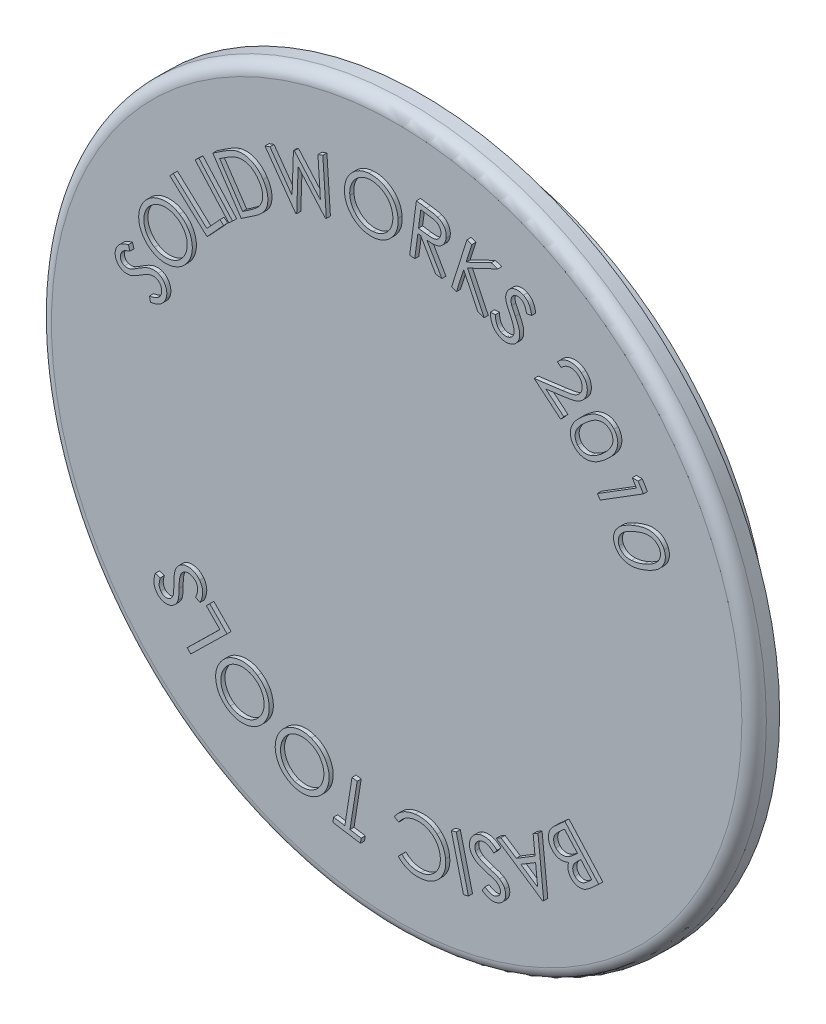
from build123d import *

# Parameters (mm, degrees)
SKETCH1_R      = 19.05
EXTRUDE1_DEPTH = 2.54
SKETCH2_R      = 22.225
EXTRUDE2_DEPTH = 1.5875
FILLET1_R      = 0.762
EXTRUDE3_DEPTH = 0.254


with BuildPart() as part:
    # Sketch1 → Extrude1 (new body)
    with BuildSketch(Plane.XY):
        with Locations((0, -38.1)):
            Circle(SKETCH1_R)
    extrude(amount=-EXTRUDE1_DEPTH)

    # Sketch2 → Extrude2 (add)
    with BuildSketch(Plane.XY):
        with Locations((0, -38.1)):
            Circle(SKETCH2_R)
    extrude(amount=EXTRUDE2_DEPTH)

    # Fillet1
    fillet1_edges = [part.edges().sort_by_distance(p)[0] for p in [
        (-22.225, -38.1, 1.5875),
    ]]
    fillet(fillet1_edges, radius=FILLET1_R)

    # Sketch3 → Extrude3 (add)
    # profile 1 of 24: a face of its own
    with BuildSketch(Plane.XY.offset(1.5875)):
        with BuildLine():
            add(Edge.make_bspline(
                [(14.937870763, -30.673177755), (14.984820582, -30.654013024), (15.076113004, -30.616747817), (15.210902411, -30.567396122), (15.338974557, -30.524141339), (15.460629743, -30.489306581), (15.5758449, -30.461631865), (15.684257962, -30.440976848), (15.786444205, -30.428132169), (15.882489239, -30.422138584), (15.973602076, -30.423097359), (16.060767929, -30.428296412), (16.144343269, -30.440281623), (16.224682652, -30.455542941), (16.301306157, -30.477568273), (16.374546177, -30.504071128), (16.444251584, -30.536108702), (16.510338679, -30.572972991), (16.572611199, -30.614265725), (16.630703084, -30.65951291), (16.684313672, -30.708629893), (16.733474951, -30.76157437), (16.778249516, -30.818653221), (16.81881523, -30.879370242), (16.854729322, -30.944169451), (16.875071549, -30.989337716), (16.885356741, -31.012175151)],
                knots=[0, 0, 0, 0, 1.642061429, 3.192936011, 4.64754815, 6.018742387, 7.289305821, 8.48368643, 9.590715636, 10.62239321, 11.597318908, 12.539920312, 13.44775176, 14.3296684, 15.185959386, 16.026500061, 16.849816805, 17.667359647, 18.474720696, 19.267143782, 20.049479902, 20.826768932, 21.604148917, 22.396274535, 23.189143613, 24, 24, 24, 24], degree=3))
            add(Edge.make_bspline(
                [(16.885356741, -31.012175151), (16.894636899, -31.035787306), (16.913050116, -31.082637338), (16.93388265, -31.154817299), (16.949151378, -31.227307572), (16.959014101, -31.300218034), (16.961950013, -31.373638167), (16.959436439, -31.447630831), (16.951080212, -31.52203406), (16.937209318, -31.596755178), (16.916665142, -31.670870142), (16.890738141, -31.74471028), (16.857107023, -31.817031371), (16.818424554, -31.889412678), (16.772486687, -31.960505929), (16.719902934, -32.030387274), (16.66214137, -32.100174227), (16.596656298, -32.168320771), (16.524324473, -32.236033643), (16.442700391, -32.301501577), (16.353247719, -32.366559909), (16.253999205, -32.429201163), (16.146585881, -32.491649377), (16.029973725, -32.552521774), (15.904785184, -32.612301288), (15.817616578, -32.649794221), (15.772961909, -32.669001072)],
                knots=[0, 0, 0, 0, 0.815397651, 1.617870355, 2.412019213, 3.195831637, 3.980503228, 4.771720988, 5.574193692, 6.385735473, 7.212592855, 8.04485578, 8.898997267, 9.774364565, 10.681996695, 11.61726442, 12.58520076, 13.592910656, 14.654055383, 15.768720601, 16.95501855, 18.208752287, 19.540471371, 20.949174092, 22.437125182, 24, 24, 24, 24], degree=3))
            add(Edge.make_bspline(
                [(15.772961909, -32.669001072), (15.72814177, -32.687343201), (15.640738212, -32.723112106), (15.510848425, -32.770048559), (15.386469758, -32.810490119), (15.266855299, -32.842839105), (15.15306022, -32.869366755), (15.044046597, -32.88768438), (14.940725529, -32.900362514), (14.842070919, -32.904795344), (14.748242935, -32.902439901), (14.658342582, -32.896631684), (14.572031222, -32.884511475), (14.489686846, -32.866609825), (14.410780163, -32.844349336), (14.335384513, -32.81703516), (14.263659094, -32.784107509), (14.196044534, -32.745634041), (14.132472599, -32.703121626), (14.073167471, -32.65654947), (14.018217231, -32.60642379), (13.968527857, -32.551737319), (13.922606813, -32.494223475), (13.88173758, -32.432310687), (13.844441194, -32.367171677), (13.824213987, -32.320879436), (13.814027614, -32.297566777)],
                knots=[0, 0, 0, 0, 1.558151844, 3.038545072, 4.443005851, 5.765287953, 7.024676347, 8.201147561, 9.320641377, 10.372294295, 11.375318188, 12.33961811, 13.269647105, 14.176827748, 15.049227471, 15.905990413, 16.754566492, 17.585491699, 18.406642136, 19.213182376, 20.009823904, 20.796826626, 21.588428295, 22.375519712, 23.181915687, 24, 24, 24, 24], degree=3))
            add(Edge.make_bspline(
                [(13.814027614, -32.297566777), (13.80468243, -32.274184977), (13.786240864, -32.228043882), (13.766506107, -32.156911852), (13.750383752, -32.085934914), (13.742204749, -32.014312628), (13.737748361, -31.942284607), (13.740664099, -31.869948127), (13.748849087, -31.797217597), (13.763085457, -31.724556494), (13.782366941, -31.651735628), (13.809739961, -31.580309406), (13.841066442, -31.508949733), (13.880684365, -31.439828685), (13.924839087, -31.370596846), (13.976852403, -31.303786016), (14.033625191, -31.236843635), (14.097689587, -31.171334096), (14.169091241, -31.105559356), (14.251240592, -31.042662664), (14.341636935, -30.978575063), (14.442160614, -30.915873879), (14.552692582, -30.854441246), (14.672217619, -30.792710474), (14.801409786, -30.731613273), (14.891523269, -30.693024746), (14.937870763, -30.673177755)],
                knots=[0, 0, 0, 0, 0.815465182, 1.609219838, 2.389537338, 3.171909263, 3.942577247, 4.726365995, 5.514749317, 6.312508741, 7.124260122, 7.952592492, 8.789092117, 9.647348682, 10.531669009, 11.448312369, 12.388851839, 13.375257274, 14.416134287, 15.532219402, 16.725579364, 18.006723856, 19.369527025, 20.823104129, 22.36604737, 24, 24, 24, 24], degree=3))
        make_face()
        with BuildLine():
            add(Edge.make_bspline(
                [(15.047901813, -30.952389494), (15.007928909, -30.969300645), (14.930478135, -31.002067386), (14.819817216, -31.053963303), (14.717555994, -31.104367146), (14.624136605, -31.154745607), (14.539613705, -31.20503481), (14.463268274, -31.254144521), (14.395891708, -31.303361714), (14.336951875, -31.352587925), (14.284782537, -31.402372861), (14.237693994, -31.452180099), (14.196047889, -31.503585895), (14.159080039, -31.555843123), (14.126425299, -31.608909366), (14.099718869, -31.663620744), (14.077123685, -31.71895418), (14.054933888, -31.793102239), (14.037848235, -31.885196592), (14.034503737, -31.993672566), (14.047411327, -32.098737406), (14.071194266, -32.16391386), (14.083063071, -32.196439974)],
                knots=[0, 0, 0, 0, 1.479565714, 2.866779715, 4.166182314, 5.36600565, 6.484085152, 7.518533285, 8.459636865, 9.326752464, 10.134512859, 10.916878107, 11.661894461, 12.387839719, 13.098108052, 13.783370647, 14.461159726, 15.13337657, 16.419199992, 17.641219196, 18.82285752, 20, 20, 20, 20], degree=3))
            add(Edge.make_bspline(
                [(14.083063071, -32.196439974), (14.098160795, -32.227764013), (14.128272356, -32.290238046), (14.192084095, -32.374142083), (14.27104316, -32.446816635), (14.346752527, -32.499388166), (14.414189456, -32.534394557), (14.468761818, -32.556678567), (14.525907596, -32.575156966), (14.58610578, -32.589234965), (14.649309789, -32.598486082), (14.71535095, -32.604340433), (14.784409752, -32.605481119), (14.831238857, -32.603322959), (14.855188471, -32.602219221)],
                knots=[0, 0, 0, 0, 1.338136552, 2.66883805, 4.033645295, 5.46200674, 6.207797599, 6.959166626, 7.732057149, 8.521158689, 9.339602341, 10.192856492, 11.075780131, 12, 12, 12, 12], degree=3))
            add(Edge.make_bspline(
                [(14.855188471, -32.602219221), (14.88555028, -32.600087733), (14.947120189, -32.595765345), (15.040335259, -32.581385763), (15.136259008, -32.564290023), (15.23444976, -32.539940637), (15.335550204, -32.512225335), (15.439226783, -32.479272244), (15.54497053, -32.439970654), (15.615932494, -32.411370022), (15.65211856, -32.396785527)],
                knots=[0, 0, 0, 0, 0.883155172, 1.790927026, 2.736064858, 3.710794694, 4.726101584, 5.779059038, 6.867462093, 8, 8, 8, 8], degree=3))
            add(Edge.make_bspline(
                [(15.65211856, -32.396785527), (15.687838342, -32.381540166), (15.757839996, -32.351663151), (15.85855173, -32.30404294), (15.953244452, -32.255616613), (16.041419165, -32.206051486), (16.123854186, -32.156039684), (16.199469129, -32.104162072), (16.269753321, -32.052587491), (16.332790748, -31.998712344), (16.390222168, -31.944493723), (16.442384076, -31.890231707), (16.488286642, -31.83525949), (16.528827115, -31.78047637), (16.563164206, -31.724793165), (16.592714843, -31.669167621), (16.615688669, -31.612841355), (16.638299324, -31.538747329), (16.654792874, -31.447198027), (16.659417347, -31.339399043), (16.646125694, -31.235452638), (16.622819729, -31.170856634), (16.611233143, -31.138742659)],
                knots=[0, 0, 0, 0, 1.324778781, 2.596228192, 3.79949165, 4.952247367, 6.046265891, 7.087368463, 8.079647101, 9.018651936, 9.913971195, 10.773370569, 11.58455201, 12.35556626, 13.096129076, 13.814280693, 14.501921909, 15.167649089, 16.454290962, 17.662867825, 18.838092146, 20, 20, 20, 20], degree=3))
            add(Edge.make_bspline(
                [(16.611233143, -31.138742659), (16.596260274, -31.107114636), (16.566367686, -31.043970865), (16.500548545, -30.960680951), (16.421508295, -30.886532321), (16.344085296, -30.834904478), (16.276034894, -30.79942847), (16.221267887, -30.776720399), (16.163970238, -30.757453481), (16.103758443, -30.742818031), (16.040595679, -30.732663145), (15.974471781, -30.727207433), (15.90568069, -30.725367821), (15.833666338, -30.727135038), (15.756918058, -30.734245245), (15.674588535, -30.747928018), (15.585741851, -30.767353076), (15.490370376, -30.792041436), (15.388721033, -30.823621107), (15.280441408, -30.860428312), (15.166052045, -30.903876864), (15.088108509, -30.935880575), (15.047901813, -30.952389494)],
                knots=[0, 0, 0, 0, 1.18934298, 2.374464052, 3.591192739, 4.87181353, 5.531106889, 6.204775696, 6.890276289, 7.589539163, 8.314176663, 9.068469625, 9.849158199, 10.658739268, 11.522276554, 12.473809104, 13.501323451, 14.62123087, 15.830361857, 17.128275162, 18.518638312, 20, 20, 20, 20], degree=3))
        make_face(mode=Mode.SUBTRACT)
    # profile 2 of 24: a face of its own
    with BuildSketch(Plane.XY.offset(1.5875)):
        Polygon((15.266748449, -28.124319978), (15.595569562, -28.652850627), (12.905851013, -30.327485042), (12.739214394, -30.060357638), (15.165621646, -28.549815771), (14.902946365, -28.127500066), align=None)
    # profile 3 of 24: a face of its own
    with BuildSketch(Plane.XY.offset(1.5875)):
        with BuildLine():
            add(Edge.make_bspline(
                [(11.833057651, -26.364107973), (11.871223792, -26.331422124), (11.945379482, -26.267914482), (12.056799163, -26.179523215), (12.164206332, -26.099762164), (12.267823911, -26.029227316), (12.367215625, -25.966872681), (12.463099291, -25.914232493), (12.554853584, -25.869823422), (12.643317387, -25.834447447), (12.729171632, -25.807170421), (12.812588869, -25.785412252), (12.894500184, -25.769020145), (12.974912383, -25.759814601), (13.053755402, -25.755557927), (13.130745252, -25.758285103), (13.206221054, -25.766549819), (13.27985659, -25.780388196), (13.351236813, -25.800263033), (13.419845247, -25.82507636), (13.485846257, -25.854430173), (13.548888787, -25.888751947), (13.608876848, -25.928338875), (13.665656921, -25.973030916), (13.719235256, -26.022832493), (13.752375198, -26.059010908), (13.769095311, -26.077264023)],
                knots=[0, 0, 0, 0, 1.643324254, 3.192930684, 4.650446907, 6.01782943, 7.291554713, 8.486302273, 9.593475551, 10.623535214, 11.599329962, 12.53775206, 13.442047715, 14.328760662, 15.182631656, 16.022079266, 16.845217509, 17.663875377, 18.469658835, 19.265838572, 20.0480064, 20.829928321, 21.610711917, 22.395824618, 23.190644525, 24, 24, 24, 24], degree=3))
            add(Edge.make_bspline(
                [(13.769095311, -26.077264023), (13.785338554, -26.096501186), (13.817524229, -26.134619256), (13.859343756, -26.195930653), (13.895726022, -26.259484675), (13.927862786, -26.324876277), (13.953865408, -26.393044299), (13.974153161, -26.463312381), (13.989521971, -26.535577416), (13.999644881, -26.609957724), (14.004481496, -26.686103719), (14.001340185, -26.763718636), (13.993354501, -26.842413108), (13.978521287, -26.922348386), (13.9571407, -27.003131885), (13.930862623, -27.085464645), (13.896229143, -27.168210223), (13.85720174, -27.25321895), (13.809884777, -27.339466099), (13.75353936, -27.426464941), (13.689008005, -27.515227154), (13.615559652, -27.605287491), (13.534207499, -27.697687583), (13.443638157, -27.79110832), (13.344252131, -27.885820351), (13.274042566, -27.948215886), (13.238020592, -27.980228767)],
                knots=[0, 0, 0, 0, 0.817217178, 1.619300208, 2.405807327, 3.19409037, 3.983004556, 4.771738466, 5.567085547, 6.380115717, 7.207707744, 8.04123527, 8.899641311, 9.774700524, 10.678118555, 11.612158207, 12.578720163, 13.58901858, 14.648957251, 15.77001204, 16.952972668, 18.211026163, 19.54266193, 20.949827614, 22.435067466, 24, 24, 24, 24], degree=3))
            add(Edge.make_bspline(
                [(13.238020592, -27.980228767), (13.201573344, -28.011460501), (13.130500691, -28.072362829), (13.022881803, -28.156655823), (12.9187952, -28.233537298), (12.816601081, -28.300969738), (12.7176425, -28.360824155), (12.621600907, -28.41293407), (12.527661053, -28.4554748), (12.436667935, -28.49092129), (12.347593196, -28.518018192), (12.261100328, -28.540123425), (12.176252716, -28.555201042), (12.093438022, -28.565170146), (12.01221572, -28.568117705), (11.932880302, -28.56597333), (11.855301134, -28.556742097), (11.779780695, -28.54229886), (11.706811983, -28.522069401), (11.637104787, -28.496161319), (11.569786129, -28.466502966), (11.505935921, -28.430838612), (11.444897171, -28.390442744), (11.387242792, -28.345179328), (11.331749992, -28.29561177), (11.298467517, -28.258498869), (11.281630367, -28.239723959)],
                knots=[0, 0, 0, 0, 1.560267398, 3.04254366, 4.443186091, 5.766032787, 7.021366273, 8.202410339, 9.315876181, 10.371883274, 11.374728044, 12.340949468, 13.272450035, 14.174412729, 15.050431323, 15.912427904, 16.751977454, 17.587357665, 18.410103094, 19.210369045, 20.003269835, 20.79925021, 21.584928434, 22.380461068, 23.180697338, 24, 24, 24, 24], degree=3))
            add(Edge.make_bspline(
                [(11.281630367, -28.239723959), (11.265861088, -28.220656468), (11.234643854, -28.182910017), (11.193235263, -28.12268935), (11.156754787, -28.060540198), (11.126554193, -27.995740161), (11.099610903, -27.929691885), (11.080673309, -27.860534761), (11.064875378, -27.789968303), (11.055467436, -27.717170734), (11.051790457, -27.642761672), (11.053298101, -27.566985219), (11.062705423, -27.49049242), (11.07748136, -27.413189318), (11.097630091, -27.334560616), (11.125428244, -27.255356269), (11.158428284, -27.174937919), (11.198285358, -27.093531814), (11.245767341, -27.010072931), (11.302410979, -26.924551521), (11.368392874, -26.836741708), (11.442750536, -26.746233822), (11.527396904, -26.654053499), (11.620585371, -26.558875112), (11.723239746, -26.461496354), (11.795764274, -26.397180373), (11.833057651, -26.364107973)],
                knots=[0, 0, 0, 0, 0.809983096, 1.603461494, 2.390596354, 3.167002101, 3.943159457, 4.723281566, 5.511762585, 6.310086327, 7.12348427, 7.94996326, 8.788773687, 9.643918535, 10.526334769, 11.444124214, 12.390513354, 13.371738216, 14.410313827, 15.532977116, 16.728564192, 18.006018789, 19.367430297, 20.825608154, 22.367672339, 24, 24, 24, 24], degree=3))
        make_face()
        with BuildLine():
            add(Edge.make_bspline(
                [(12.023226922, -26.591166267), (11.991125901, -26.619687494), (11.928970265, -26.674911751), (11.840125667, -26.756754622), (11.760157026, -26.836298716), (11.687767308, -26.912466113), (11.624552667, -26.986431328), (11.567812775, -27.056169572), (11.520236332, -27.123787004), (11.479417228, -27.188306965), (11.446300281, -27.251648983), (11.417343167, -27.313210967), (11.393747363, -27.374419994), (11.375061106, -27.435162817), (11.361722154, -27.495371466), (11.353478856, -27.555144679), (11.349404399, -27.614253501), (11.351321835, -27.691014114), (11.363567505, -27.782998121), (11.394621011, -27.885994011), (11.439051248, -27.980878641), (11.481718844, -28.034793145), (11.502964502, -28.061639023)],
                knots=[0, 0, 0, 0, 1.47794591, 2.861674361, 4.156738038, 5.359461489, 6.476983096, 7.504865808, 8.45234704, 9.320935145, 10.130446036, 10.91068574, 11.661399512, 12.386168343, 13.096092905, 13.781287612, 14.461295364, 15.132754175, 16.421636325, 17.640519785, 18.825134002, 20, 20, 20, 20], degree=3))
            add(Edge.make_bspline(
                [(11.502964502, -28.061639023), (11.526694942, -28.086590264), (11.574161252, -28.136498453), (11.661360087, -28.193766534), (11.757349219, -28.239503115), (11.845351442, -28.26378931), (11.919709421, -28.275467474), (11.977771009, -28.280059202), (12.037358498, -28.279335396), (12.098125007, -28.273406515), (12.160439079, -28.263232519), (12.224144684, -28.247736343), (12.289365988, -28.227550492), (12.332638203, -28.210731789), (12.354592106, -28.202198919)],
                knots=[0, 0, 0, 0, 1.337529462, 2.675364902, 4.035049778, 5.467944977, 6.21206567, 6.965886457, 7.734049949, 8.530423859, 9.342406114, 10.191794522, 11.082617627, 12, 12, 12, 12], degree=3))
            add(Edge.make_bspline(
                [(12.354592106, -28.202198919), (12.382264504, -28.190576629), (12.438615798, -28.166909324), (12.522507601, -28.126036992), (12.607430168, -28.079709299), (12.692158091, -28.026245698), (12.779251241, -27.969455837), (12.866101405, -27.90549135), (12.953866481, -27.836264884), (13.011545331, -27.787072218), (13.040855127, -27.76207472)],
                knots=[0, 0, 0, 0, 0.879303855, 1.790589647, 2.733059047, 3.712217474, 4.725292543, 5.778941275, 6.871357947, 8, 8, 8, 8], degree=3))
            add(Edge.make_bspline(
                [(13.040855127, -27.76207472), (13.069880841, -27.736634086), (13.12665097, -27.686875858), (13.2065624, -27.610427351), (13.280554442, -27.535500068), (13.347995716, -27.461467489), (13.41009303, -27.389159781), (13.465304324, -27.317266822), (13.514705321, -27.246601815), (13.55730298, -27.176538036), (13.594006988, -27.107753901), (13.62653482, -27.040834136), (13.652126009, -26.974689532), (13.673842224, -26.910628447), (13.688114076, -26.847433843), (13.698721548, -26.786137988), (13.703307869, -26.725856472), (13.701321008, -26.64906988), (13.688820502, -26.557660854), (13.659012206, -26.455138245), (13.613907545, -26.361614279), (13.571889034, -26.308103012), (13.550941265, -26.281425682)],
                knots=[0, 0, 0, 0, 1.329393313, 2.600102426, 3.808510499, 4.956069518, 6.049193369, 7.090673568, 8.077244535, 9.017848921, 9.913105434, 10.762414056, 11.578808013, 12.354776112, 13.08990911, 13.807865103, 14.496240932, 15.168268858, 16.451008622, 17.66184167, 18.834342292, 20, 20, 20, 20], degree=3))
            add(Edge.make_bspline(
                [(13.550941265, -26.281425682), (13.527159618, -26.256559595), (13.479508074, -26.206735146), (13.392548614, -26.147867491), (13.294414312, -26.104042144), (13.205580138, -26.078965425), (13.130434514, -26.066104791), (13.071673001, -26.061957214), (13.011708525, -26.061768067), (12.950444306, -26.066976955), (12.888020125, -26.077371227), (12.824148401, -26.092226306), (12.758761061, -26.11099525), (12.691825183, -26.135906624), (12.621630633, -26.165576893), (12.548792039, -26.204651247), (12.470816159, -26.249416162), (12.389824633, -26.303571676), (12.30348626, -26.363833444), (12.213781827, -26.432729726), (12.119080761, -26.508467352), (12.055910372, -26.562968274), (12.023226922, -26.591166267)],
                knots=[0, 0, 0, 0, 1.181839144, 2.368064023, 3.586296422, 4.868431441, 5.534306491, 6.207658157, 6.893665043, 7.59669626, 8.321364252, 9.070213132, 9.85313679, 10.661200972, 11.527476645, 12.474102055, 13.504250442, 14.621575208, 15.82628898, 17.128271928, 18.51420925, 20, 20, 20, 20], degree=3))
        make_face(mode=Mode.SUBTRACT)
    # profile 4 of 24: a face of its own
    with BuildSketch(Plane.XY.offset(1.5875)):
        with BuildLine():
            Line((10.48286581, -24.403889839), (10.250083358, -24.209904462))
            add(Edge.make_bspline(
                [(10.250083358, -24.209904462), (10.276133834, -24.181895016), (10.327255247, -24.126929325), (10.410220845, -24.053599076), (10.496794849, -23.990186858), (10.586498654, -23.935645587), (10.680344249, -23.891561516), (10.77772703, -23.858051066), (10.878050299, -23.832597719), (10.981286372, -23.818649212), (11.084968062, -23.812982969), (11.187042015, -23.818992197), (11.286455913, -23.834433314), (11.383546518, -23.858762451), (11.477541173, -23.895327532), (11.569386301, -23.940298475), (11.658506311, -23.995937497), (11.713966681, -24.039955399), (11.742180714, -24.062348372)],
                knots=[0, 0, 0, 0, 1.099016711, 2.156708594, 3.176887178, 4.180181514, 5.169761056, 6.150728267, 7.136547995, 8.139694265, 9.14028295, 10.11684897, 11.07265997, 12.028937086, 12.987541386, 13.965930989, 14.965219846, 16, 16, 16, 16], degree=3))
            add(Edge.make_bspline(
                [(11.742180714, -24.062348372), (11.76894831, -24.085592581), (11.821449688, -24.131183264), (11.890613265, -24.206812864), (11.951299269, -24.285040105), (12.000742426, -24.36783874), (12.042174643, -24.4531027), (12.072502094, -24.542526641), (12.094609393, -24.634873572), (12.105439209, -24.729869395), (12.108005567, -24.824786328), (12.10238595, -24.917824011), (12.088466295, -25.008193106), (12.065622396, -25.095657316), (12.033347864, -25.179736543), (11.993927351, -25.261166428), (11.945307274, -25.339425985), (11.906769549, -25.387959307), (11.887192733, -25.412613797)],
                knots=[0, 0, 0, 0, 1.121354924, 2.199400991, 3.238301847, 4.249968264, 5.246541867, 6.233419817, 7.232904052, 8.246771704, 9.253775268, 10.235436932, 11.193132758, 12.143748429, 13.091018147, 14.039451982, 15.004059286, 16, 16, 16, 16], degree=3))
            add(Edge.make_bspline(
                [(11.887192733, -25.412613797), (11.857690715, -25.445455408), (11.799163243, -25.510608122), (11.697240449, -25.59341701), (11.586378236, -25.663622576), (11.485063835, -25.710275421), (11.396242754, -25.742488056), (11.319703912, -25.764629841), (11.234752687, -25.78814421), (11.140020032, -25.808308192), (11.036715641, -25.829731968), (10.923987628, -25.848995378), (10.802310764, -25.868258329), (10.7180035, -25.879819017), (10.674307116, -25.885810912)],
                knots=[0, 0, 0, 0, 1.188243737, 2.357293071, 3.525588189, 4.716781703, 5.354792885, 6.070618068, 6.863393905, 7.729777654, 8.679994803, 9.70670175, 10.811385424, 12, 12, 12, 12], degree=3))
            Line((10.674307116, -25.885810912), (9.526931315, -26.03400302))
            Line((9.526931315, -26.03400302), (10.646958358, -26.96704088))
            Line((10.646958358, -26.96704088), (10.451700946, -27.201095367))
            Line((10.451700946, -27.201095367), (8.803779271, -25.828569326))
            Line((8.803779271, -25.828569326), (10.564912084, -25.59960298))
            add(Edge.make_bspline(
                [(10.564912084, -25.59960298), (10.607753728, -25.593997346), (10.689897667, -25.583249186), (10.807965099, -25.565883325), (10.915986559, -25.549087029), (11.013708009, -25.531263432), (11.101078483, -25.513476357), (11.178400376, -25.495911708), (11.245443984, -25.477634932), (11.320791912, -25.453636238), (11.403900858, -25.416644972), (11.495178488, -25.363493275), (11.57691844, -25.298112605), (11.623468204, -25.246844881), (11.646778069, -25.221172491)],
                knots=[0, 0, 0, 0, 1.323742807, 2.538125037, 3.656185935, 4.672879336, 5.581146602, 6.387860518, 7.101676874, 7.709683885, 8.809098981, 9.88074418, 10.93877944, 12, 12, 12, 12], degree=3))
            add(Edge.make_bspline(
                [(11.646778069, -25.221172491), (11.660336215, -25.204076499), (11.687148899, -25.170267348), (11.719782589, -25.11498987), (11.747956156, -25.058379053), (11.767714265, -24.998901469), (11.782973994, -24.937740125), (11.790944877, -24.874149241), (11.792893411, -24.80833002), (11.788124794, -24.741326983), (11.778521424, -24.674557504), (11.761647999, -24.609894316), (11.739326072, -24.547929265), (11.711421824, -24.488473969), (11.676856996, -24.432159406), (11.635637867, -24.379335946), (11.589212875, -24.328697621), (11.554424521, -24.29800616), (11.53674702, -24.282410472)],
                knots=[0, 0, 0, 0, 0.995287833, 1.968288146, 2.925260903, 3.877471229, 4.823806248, 5.800124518, 6.797764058, 7.826261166, 8.864148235, 9.873881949, 10.872272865, 11.868360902, 12.867971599, 13.882705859, 14.924109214, 16, 16, 16, 16], degree=3))
            add(Edge.make_bspline(
                [(11.53674702, -24.282410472), (11.517300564, -24.26698735), (11.479179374, -24.236753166), (11.418246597, -24.198391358), (11.355828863, -24.167044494), (11.291613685, -24.142821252), (11.226140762, -24.124556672), (11.158631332, -24.114768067), (11.08985922, -24.110711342), (11.019772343, -24.114113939), (10.949353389, -24.123973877), (10.879755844, -24.142121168), (10.810967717, -24.167232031), (10.742928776, -24.199636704), (10.676125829, -24.240069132), (10.61022365, -24.28751573), (10.545301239, -24.342323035), (10.504010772, -24.383039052), (10.48286581, -24.403889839)],
                knots=[0, 0, 0, 0, 1.008128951, 1.976250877, 2.920301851, 3.842030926, 4.761703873, 5.676845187, 6.608826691, 7.557584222, 8.523864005, 9.493518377, 10.474778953, 11.496077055, 12.551127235, 13.643887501, 14.793428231, 16, 16, 16, 16], degree=3))
        make_face()
    # profile 5 of 24: a face of its own
    with BuildSketch(Plane.XY.offset(1.5875)):
        with BuildLine():
            Line((6.077519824, -23.625568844), (6.391076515, -23.602036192))
            add(Edge.make_bspline(
                [(6.391076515, -23.602036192), (6.393406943, -23.649598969), (6.397858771, -23.740458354), (6.417640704, -23.869984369), (6.44718594, -23.985957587), (6.485804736, -24.089237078), (6.534470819, -24.179471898), (6.594749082, -24.255425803), (6.663505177, -24.319774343), (6.71728975, -24.350139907), (6.744066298, -24.365257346)],
                knots=[0, 0, 0, 0, 1.293479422, 2.470939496, 3.553943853, 4.540517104, 5.46108717, 6.326721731, 7.166961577, 8, 8, 8, 8], degree=3))
            add(Edge.make_bspline(
                [(6.744066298, -24.365257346), (6.767986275, -24.376281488), (6.815393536, -24.398130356), (6.890599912, -24.419578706), (6.967501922, -24.431647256), (7.045186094, -24.434827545), (7.121866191, -24.429039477), (7.194569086, -24.411960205), (7.263332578, -24.387477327), (7.326043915, -24.35199608), (7.383119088, -24.309460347), (7.433833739, -24.261154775), (7.476557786, -24.206362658), (7.498696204, -24.166088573), (7.509831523, -24.145831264)],
                knots=[0, 0, 0, 0, 1.068615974, 2.117901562, 3.164214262, 4.224364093, 5.269967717, 6.276944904, 7.249642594, 8.224967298, 9.191238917, 10.135303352, 11.062083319, 12, 12, 12, 12], degree=3))
            add(Edge.make_bspline(
                [(7.509831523, -24.145831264), (7.520720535, -24.121554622), (7.542735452, -24.072473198), (7.559029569, -23.991643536), (7.563756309, -23.905882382), (7.55713786, -23.847713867), (7.553716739, -23.817646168)],
                knots=[0, 0, 0, 0, 0.946866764, 1.914332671, 2.921904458, 4, 4, 4, 4], degree=3))
            add(Edge.make_bspline(
                [(7.553716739, -23.817646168), (7.54970361, -23.795339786), (7.541283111, -23.748535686), (7.523261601, -23.675620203), (7.498648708, -23.597149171), (7.469642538, -23.51254871), (7.434171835, -23.422568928), (7.393359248, -23.326544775), (7.347227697, -23.224387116), (7.313083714, -23.155029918), (7.295493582, -23.119298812)],
                knots=[0, 0, 0, 0, 0.727952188, 1.527417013, 2.410675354, 3.369109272, 4.399849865, 5.516781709, 6.720707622, 8, 8, 8, 8], degree=3))
            add(Edge.make_bspline(
                [(7.295493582, -23.119298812), (7.27797664, -23.083745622), (7.244530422, -23.01586164), (7.198688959, -22.917607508), (7.158663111, -22.828409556), (7.124652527, -22.747857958), (7.096666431, -22.676160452), (7.074187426, -22.61331265), (7.05755524, -22.559298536), (7.051023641, -22.52574), (7.048082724, -22.510629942)],
                knots=[0, 0, 0, 0, 1.444268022, 2.75763337, 3.950744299, 5.006791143, 5.94363917, 6.754872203, 7.439369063, 8, 8, 8, 8], degree=3))
            add(Edge.make_bspline(
                [(7.048082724, -22.510629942), (7.044623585, -22.487982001), (7.037761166, -22.443051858), (7.032479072, -22.375889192), (7.033236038, -22.309941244), (7.038973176, -22.245515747), (7.04954793, -22.182204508), (7.066509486, -22.120734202), (7.087208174, -22.060019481), (7.105572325, -22.021371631), (7.114864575, -22.001815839)],
                knots=[0, 0, 0, 0, 1.052448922, 2.087901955, 3.091243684, 4.078954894, 5.057400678, 6.035604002, 7.006016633, 8, 8, 8, 8], degree=3))
            add(Edge.make_bspline(
                [(7.114864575, -22.001815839), (7.131071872, -21.972093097), (7.163008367, -21.913524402), (7.223501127, -21.83455939), (7.293540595, -21.766210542), (7.371362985, -21.707318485), (7.456434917, -21.659508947), (7.547584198, -21.624576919), (7.643272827, -21.601000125), (7.74285408, -21.592280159), (7.843867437, -21.594502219), (7.944207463, -21.609744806), (8.04251645, -21.638560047), (8.104812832, -21.666923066), (8.136308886, -21.681262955)],
                knots=[0, 0, 0, 0, 1.019711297, 2.009342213, 2.985773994, 3.96258238, 4.944252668, 5.917729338, 6.897649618, 7.905874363, 8.922635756, 9.937949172, 10.957460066, 12, 12, 12, 12], degree=3))
            add(Edge.make_bspline(
                [(8.136308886, -21.681262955), (8.168700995, -21.698788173), (8.23304103, -21.733598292), (8.318872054, -21.801989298), (8.397089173, -21.87895058), (8.452502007, -21.953578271), (8.493175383, -22.018820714), (8.520912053, -22.074249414), (8.547749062, -22.134330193), (8.57188021, -22.200498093), (8.593864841, -22.27210968), (8.614238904, -22.349338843), (8.632639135, -22.431883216), (8.642990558, -22.488966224), (8.648303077, -22.518262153)],
                knots=[0, 0, 0, 0, 1.293517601, 2.569297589, 3.845775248, 5.145237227, 5.828428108, 6.549037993, 7.323862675, 8.14281841, 9.025255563, 9.958892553, 10.952470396, 12, 12, 12, 12], degree=3))
            Line((8.648303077, -22.518262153), (8.32838621, -22.57804781))
            add(Edge.make_bspline(
                [(8.32838621, -22.57804781), (8.323852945, -22.554488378), (8.315130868, -22.509159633), (8.300421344, -22.444062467), (8.285186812, -22.384244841), (8.269527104, -22.329364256), (8.252438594, -22.279929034), (8.234543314, -22.235807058), (8.21639461, -22.196627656), (8.190127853, -22.152316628), (8.154540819, -22.102724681), (8.104137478, -22.051425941), (8.047300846, -22.006917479), (8.005008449, -21.983660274), (7.983664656, -21.971923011)],
                knots=[0, 0, 0, 0, 1.187876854, 2.285495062, 3.303904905, 4.24405217, 5.110516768, 5.892202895, 6.601224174, 7.245767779, 8.440489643, 9.613382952, 10.795540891, 12, 12, 12, 12], degree=3))
            add(Edge.make_bspline(
                [(7.983664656, -21.971923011), (7.955651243, -21.959158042), (7.901541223, -21.934501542), (7.81601617, -21.916541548), (7.731805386, -21.915522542), (7.650868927, -21.932475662), (7.575669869, -21.963169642), (7.50974509, -22.008147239), (7.454383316, -22.066236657), (7.427910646, -22.112891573), (7.414428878, -22.136651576)],
                knots=[0, 0, 0, 0, 1.112337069, 2.148562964, 3.139226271, 4.142253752, 5.123436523, 6.062766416, 7.013422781, 8, 8, 8, 8], degree=3))
            add(Edge.make_bspline(
                [(7.414428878, -22.136651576), (7.407355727, -22.1522196), (7.393180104, -22.183420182), (7.377087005, -22.232558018), (7.367238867, -22.283626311), (7.361628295, -22.336870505), (7.363451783, -22.39383016), (7.371111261, -22.456075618), (7.386799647, -22.523792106), (7.401188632, -22.570293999), (7.40870472, -22.594584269)],
                knots=[0, 0, 0, 0, 0.870543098, 1.74469482, 2.625622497, 3.515242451, 4.465690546, 5.521057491, 6.705124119, 8, 8, 8, 8], degree=3))
            add(Edge.make_bspline(
                [(7.40870472, -22.594584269), (7.411775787, -22.603109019), (7.419094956, -22.623425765), (7.435209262, -22.657769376), (7.455066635, -22.70208426), (7.480851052, -22.75557042), (7.51136408, -22.818541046), (7.546913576, -22.891189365), (7.588420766, -22.973047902), (7.617743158, -23.030892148), (7.633218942, -23.061421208)],
                knots=[0, 0, 0, 0, 0.419466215, 0.999699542, 1.755440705, 2.66897357, 3.749282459, 4.996406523, 6.414762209, 8, 8, 8, 8], degree=3))
            add(Edge.make_bspline(
                [(7.633218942, -23.061421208), (7.651586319, -23.098454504), (7.68719065, -23.170241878), (7.736715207, -23.275659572), (7.778228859, -23.376372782), (7.815279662, -23.470977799), (7.844161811, -23.560819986), (7.868120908, -23.644689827), (7.885639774, -23.723233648), (7.89648315, -23.797033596), (7.902259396, -23.866929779), (7.903721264, -23.934076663), (7.900274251, -23.99905039), (7.893803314, -24.06230237), (7.881351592, -24.123199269), (7.865547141, -24.182156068), (7.845319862, -24.23906018), (7.828150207, -24.275287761), (7.819572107, -24.293387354)],
                knots=[0, 0, 0, 0, 1.533354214, 2.972337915, 4.318857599, 5.573369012, 6.739674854, 7.817699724, 8.807972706, 9.722133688, 10.582201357, 11.408046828, 12.211114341, 12.994418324, 13.763983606, 14.513685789, 15.257425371, 16, 16, 16, 16], degree=3))
            add(Edge.make_bspline(
                [(7.819572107, -24.293387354), (7.806056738, -24.31826752), (7.77930895, -24.367506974), (7.731238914, -24.435648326), (7.677620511, -24.497939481), (7.617448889, -24.553633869), (7.550778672, -24.602529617), (7.47862188, -24.646229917), (7.400048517, -24.682913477), (7.316840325, -24.713191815), (7.230834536, -24.735917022), (7.144221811, -24.750888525), (7.057696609, -24.756440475), (6.971613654, -24.75412325), (6.885914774, -24.742557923), (6.800768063, -24.721869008), (6.715965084, -24.692727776), (6.661168, -24.667031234), (6.633399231, -24.654009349)],
                knots=[0, 0, 0, 0, 0.986527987, 1.952402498, 2.90089507, 3.847657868, 4.804181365, 5.77903702, 6.784246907, 7.822479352, 8.862394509, 9.881960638, 10.882075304, 11.880412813, 12.879816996, 13.890988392, 14.931245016, 16, 16, 16, 16], degree=3))
            add(Edge.make_bspline(
                [(6.633399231, -24.654009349), (6.612210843, -24.642901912), (6.570487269, -24.621029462), (6.511782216, -24.5825309), (6.455301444, -24.542624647), (6.404108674, -24.496684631), (6.355449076, -24.448850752), (6.311486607, -24.396399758), (6.269851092, -24.34154075), (6.232851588, -24.281809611), (6.199741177, -24.217704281), (6.169663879, -24.149060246), (6.144147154, -24.074830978), (6.123692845, -23.995127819), (6.105651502, -23.910309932), (6.091756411, -23.82008367), (6.082304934, -23.7245261), (6.07914049, -23.659084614), (6.077519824, -23.625568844)],
                knots=[0, 0, 0, 0, 0.929210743, 1.829775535, 2.726373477, 3.613914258, 4.499540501, 5.37630602, 6.271160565, 7.174285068, 8.103020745, 9.073546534, 10.084605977, 11.149881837, 12.269811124, 13.453836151, 14.695985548, 16, 16, 16, 16], degree=3))
        make_face()
    # profile 6 of 24: a face of its own
    with BuildSketch(Plane.XY.offset(1.5875)):
        Polygon((4.624979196, -20.45713772), (4.932175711, -20.554448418), (4.573461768, -21.684651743), (6.13361301, -20.936058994), (6.54130031, -21.065170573), (4.664412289, -21.957503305), (5.697940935, -24.11233103), (5.298521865, -23.985763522), (4.422089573, -22.161664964), (3.976241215, -23.565991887), (3.669044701, -23.46868119), align=None)
    # profile 7 of 24: a face of its own
    with BuildSketch(Plane.XY.offset(1.5875)):
        with BuildLine():
            Line((1.483045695, -19.926002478), (2.10634297, -20.009320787))
            add(Edge.make_bspline(
                [(2.10634297, -20.009320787), (2.147910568, -20.014942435), (2.227718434, -20.025735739), (2.342009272, -20.042850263), (2.445715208, -20.059912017), (2.538597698, -20.077036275), (2.620749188, -20.093913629), (2.692061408, -20.111466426), (2.753392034, -20.127011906), (2.789926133, -20.140094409), (2.806598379, -20.146064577)],
                knots=[0, 0, 0, 0, 1.408805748, 2.70484194, 3.881305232, 4.938531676, 5.876985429, 6.697332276, 7.405530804, 8, 8, 8, 8], degree=3))
            add(Edge.make_bspline(
                [(2.806598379, -20.146064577), (2.828603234, -20.154804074), (2.872122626, -20.172088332), (2.933777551, -20.204299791), (2.991871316, -20.239903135), (3.046321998, -20.279429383), (3.096713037, -20.323533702), (3.1432023, -20.371771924), (3.185167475, -20.424543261), (3.224076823, -20.480027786), (3.257804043, -20.539181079), (3.285691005, -20.600989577), (3.308446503, -20.664902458), (3.32388491, -20.731551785), (3.335075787, -20.80014985), (3.339395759, -20.87128703), (3.337285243, -20.944651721), (3.332064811, -20.994114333), (3.329404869, -21.019316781)],
                knots=[0, 0, 0, 0, 1.028137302, 2.033365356, 3.017609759, 3.98673777, 4.952928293, 5.923630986, 6.893240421, 7.879551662, 8.865561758, 9.846697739, 10.822631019, 11.807909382, 12.814992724, 13.839492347, 14.899166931, 16, 16, 16, 16], degree=3))
            add(Edge.make_bspline(
                [(3.329404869, -21.019316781), (3.322462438, -21.060491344), (3.308890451, -21.14098484), (3.270110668, -21.255139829), (3.217399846, -21.359625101), (3.151266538, -21.453722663), (3.072823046, -21.53692024), (2.981002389, -21.605135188), (2.878960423, -21.661270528), (2.784986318, -21.695449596), (2.703838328, -21.71555479), (2.637251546, -21.726658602), (2.565971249, -21.735319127), (2.489474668, -21.738410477), (2.407984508, -21.739545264), (2.321659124, -21.735042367), (2.230402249, -21.728411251), (2.168223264, -21.720894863), (2.136235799, -21.717028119)],
                knots=[0, 0, 0, 0, 1.27382615, 2.490244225, 3.666062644, 4.8374502, 5.991707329, 7.14310889, 8.316821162, 9.537884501, 10.184979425, 10.868476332, 11.598636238, 12.376703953, 13.205632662, 14.087199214, 15.01597547, 16, 16, 16, 16], degree=3))
            Line((2.136235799, -21.717028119), (3.067365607, -23.321700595))
            Line((3.067365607, -23.321700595), (2.680030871, -23.270183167))
            Line((2.680030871, -23.270183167), (1.751445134, -21.666146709))
            Line((1.751445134, -21.666146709), (1.57272418, -21.641978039))
            Line((1.57272418, -21.641978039), (1.378738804, -23.096550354))
            Line((1.378738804, -23.096550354), (1.065818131, -23.054573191))
            Line((1.065818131, -23.054573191), (1.483045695, -19.926002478))
        make_face()
        with BuildLine():
            Line((1.75526124, -20.274540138), (1.613429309, -21.337961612))
            Line((1.613429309, -21.337961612), (2.150864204, -21.41364771))
            add(Edge.make_bspline(
                [(2.150864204, -21.41364771), (2.176084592, -21.41668159), (2.224783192, -21.422539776), (2.295543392, -21.429968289), (2.361557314, -21.433717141), (2.422854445, -21.434789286), (2.479342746, -21.434819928), (2.530871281, -21.430549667), (2.577755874, -21.425451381), (2.632984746, -21.413431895), (2.696380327, -21.392865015), (2.766045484, -21.358515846), (2.828027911, -21.313157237), (2.881868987, -21.258256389), (2.92768463, -21.195905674), (2.964161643, -21.127693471), (2.990248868, -21.053840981), (2.999201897, -21.002319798), (3.003763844, -20.976067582)],
                knots=[0, 0, 0, 0, 1.116116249, 2.155133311, 3.125492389, 4.019915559, 4.848992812, 5.605565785, 6.290700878, 6.919162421, 8.08564513, 9.210396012, 10.31710492, 11.443436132, 12.576181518, 13.70547469, 14.83084255, 16, 16, 16, 16], degree=3))
            add(Edge.make_bspline(
                [(3.003763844, -20.976067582), (3.006292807, -20.950219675), (3.011291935, -20.899124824), (3.004198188, -20.822762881), (2.987104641, -20.748514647), (2.958258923, -20.677799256), (2.920763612, -20.611987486), (2.874085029, -20.553965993), (2.820390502, -20.503542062), (2.76807377, -20.469253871), (2.720699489, -20.445806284), (2.679169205, -20.428466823), (2.631357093, -20.413050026), (2.577984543, -20.397649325), (2.518541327, -20.383707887), (2.453106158, -20.37132337), (2.381664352, -20.359102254), (2.331936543, -20.35200987), (2.306052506, -20.348318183)],
                knots=[0, 0, 0, 0, 1.161980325, 2.296944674, 3.419626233, 4.566781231, 5.707896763, 6.803294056, 7.892738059, 8.997209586, 9.592255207, 10.261192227, 11.012550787, 11.842834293, 12.751102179, 13.748299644, 14.827957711, 16, 16, 16, 16], degree=3))
            Line((2.306052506, -20.348318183), (1.75526124, -20.274540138))
        make_face(mode=Mode.SUBTRACT)
    # profile 8 of 24: a face of its own
    with BuildSketch(Plane.XY.offset(1.5875)):
        with BuildLine():
            add(Edge.make_bspline(
                [(-1.478414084, -19.920539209), (-1.419705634, -19.917064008), (-1.304375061, -19.910237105), (-1.133491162, -19.919714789), (-0.96884214, -19.944338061), (-0.810129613, -19.984679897), (-0.657315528, -20.039976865), (-0.51110028, -20.111834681), (-0.37084927, -20.198900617), (-0.238679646, -20.300890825), (-0.115729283, -20.413435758), (-0.007032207, -20.536532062), (0.087799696, -20.667287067), (0.167490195, -20.806619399), (0.232954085, -20.953821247), (0.282805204, -21.10935798), (0.320194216, -21.272739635), (0.331613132, -21.385317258), (0.337416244, -21.442529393)],
                knots=[0, 0, 0, 0, 1.06673277, 2.095556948, 3.099616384, 4.084227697, 5.062933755, 6.043868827, 7.035851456, 8.054086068, 9.069816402, 10.056613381, 11.02954576, 11.996524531, 12.964689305, 13.947923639, 14.957131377, 16, 16, 16, 16], degree=3))
            add(Edge.make_bspline(
                [(0.337416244, -21.442529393), (0.340693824, -21.499336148), (0.347154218, -21.611307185), (0.336731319, -21.777478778), (0.312415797, -21.938411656), (0.271532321, -22.093883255), (0.214193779, -22.243664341), (0.142200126, -22.388411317), (0.054585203, -22.52788621), (-0.048244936, -22.659425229), (-0.161157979, -22.782403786), (-0.284825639, -22.890628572), (-0.415007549, -22.985864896), (-0.553883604, -23.065691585), (-0.700793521, -23.130858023), (-0.855647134, -23.180779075), (-1.017747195, -23.218190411), (-1.129269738, -23.229649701), (-1.185845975, -23.235463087)],
                knots=[0, 0, 0, 0, 1.041611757, 2.053107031, 3.043503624, 4.019478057, 4.99182904, 5.976673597, 6.976680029, 8.003714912, 9.031564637, 10.030484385, 11.009352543, 11.981990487, 12.959192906, 13.947912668, 14.958960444, 16, 16, 16, 16], degree=3))
            add(Edge.make_bspline(
                [(-1.185845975, -23.235463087), (-1.24350001, -23.23874474), (-1.356741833, -23.245190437), (-1.524614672, -23.234828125), (-1.686714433, -23.210307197), (-1.843496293, -23.170227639), (-1.994550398, -23.113743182), (-2.139903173, -23.041704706), (-2.279291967, -22.953614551), (-2.411870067, -22.852044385), (-2.534149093, -22.738768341), (-2.643018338, -22.616395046), (-2.738204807, -22.487046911), (-2.816663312, -22.348852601), (-2.882619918, -22.204177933), (-2.9325155, -22.051396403), (-2.968886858, -21.891245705), (-2.980518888, -21.781271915), (-2.986411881, -21.725557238)],
                knots=[0, 0, 0, 0, 1.058431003, 2.078929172, 3.078224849, 4.06194138, 5.041390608, 6.030923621, 7.032154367, 8.061152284, 9.090260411, 10.084580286, 11.061501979, 12.030021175, 12.994221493, 13.973068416, 14.973120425, 16, 16, 16, 16], degree=3))
            add(Edge.make_bspline(
                [(-2.986411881, -21.725557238), (-2.988887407, -21.687835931), (-2.993793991, -21.613070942), (-2.991137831, -21.50131118), (-2.983160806, -21.391074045), (-2.968151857, -21.282169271), (-2.944632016, -21.175105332), (-2.915953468, -21.069208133), (-2.878315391, -20.965489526), (-2.835692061, -20.863143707), (-2.785444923, -20.764590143), (-2.729921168, -20.670135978), (-2.669611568, -20.580166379), (-2.603320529, -20.495321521), (-2.531046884, -20.415850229), (-2.45414658, -20.340394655), (-2.371244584, -20.270533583), (-2.283652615, -20.205839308), (-2.192157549, -20.146681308), (-2.09762502, -20.093946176), (-2.000428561, -20.048106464), (-1.901290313, -20.008140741), (-1.79889829, -19.97687627), (-1.694610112, -19.9504036), (-1.587495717, -19.931062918), (-1.514942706, -19.924063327), (-1.478414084, -19.920539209)],
                knots=[0, 0, 0, 0, 1.039606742, 2.060538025, 3.072498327, 4.079723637, 5.081920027, 6.086693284, 7.095875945, 8.115323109, 9.135304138, 10.136702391, 11.128421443, 12.113237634, 13.096134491, 14.081986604, 15.075316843, 16.076290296, 17.076192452, 18.071062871, 19.052123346, 20.031309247, 21.009104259, 21.995163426, 22.990615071, 24, 24, 24, 24], degree=3))
        make_face()
        with BuildLine():
            add(Edge.make_bspline(
                [(-1.438344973, -20.228371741), (-1.467242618, -20.231076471), (-1.524929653, -20.236475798), (-1.609989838, -20.253039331), (-1.693772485, -20.273858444), (-1.77586783, -20.300521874), (-1.856119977, -20.333421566), (-1.935408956, -20.37052364), (-2.012184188, -20.415078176), (-2.087782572, -20.46348409), (-2.159648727, -20.51726107), (-2.227514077, -20.574932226), (-2.29104398, -20.635678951), (-2.349825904, -20.700336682), (-2.404143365, -20.768308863), (-2.453001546, -20.840780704), (-2.498320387, -20.916109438), (-2.538194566, -20.99508381), (-2.573435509, -21.076507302), (-2.602468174, -21.160341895), (-2.626102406, -21.24573458), (-2.644049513, -21.332833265), (-2.656133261, -21.421880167), (-2.662097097, -21.512804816), (-2.664070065, -21.605434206), (-2.6597662, -21.667481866), (-2.657590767, -21.698844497)],
                knots=[0, 0, 0, 0, 0.983008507, 1.962334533, 2.932898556, 3.907575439, 4.884156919, 5.870729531, 6.871457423, 7.889773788, 8.911404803, 9.910429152, 10.906348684, 11.887885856, 12.869659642, 13.852064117, 14.847620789, 15.846877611, 16.847786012, 17.852066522, 18.850806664, 19.848383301, 20.863425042, 21.893308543, 22.935151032, 24, 24, 24, 24], degree=3))
            add(Edge.make_bspline(
                [(-2.657590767, -21.698844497), (-2.652724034, -21.744764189), (-2.643143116, -21.835164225), (-2.614230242, -21.966684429), (-2.573333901, -22.091775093), (-2.520375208, -22.210119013), (-2.456260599, -22.322533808), (-2.380452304, -22.428504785), (-2.291865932, -22.527268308), (-2.193381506, -22.618939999), (-2.086658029, -22.700736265), (-1.975361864, -22.772078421), (-1.859184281, -22.829636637), (-1.739392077, -22.874769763), (-1.615528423, -22.908505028), (-1.487590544, -22.928408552), (-1.355466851, -22.936674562), (-1.266611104, -22.931521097), (-1.221462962, -22.92890259)],
                knots=[0, 0, 0, 0, 1.052160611, 2.071341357, 3.06333967, 4.047820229, 5.022043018, 6.009272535, 7.012371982, 8.04181641, 9.072394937, 10.074060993, 11.051109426, 12.022450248, 12.988581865, 13.972350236, 14.969738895, 16, 16, 16, 16], degree=3))
            add(Edge.make_bspline(
                [(-1.221462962, -22.92890259), (-1.191101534, -22.925872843), (-1.130976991, -22.919873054), (-1.042309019, -22.904605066), (-0.955998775, -22.883204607), (-0.871465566, -22.857494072), (-0.789200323, -22.82559578), (-0.709526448, -22.787746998), (-0.631800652, -22.745050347), (-0.556204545, -22.697548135), (-0.484078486, -22.645160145), (-0.416681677, -22.588212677), (-0.353100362, -22.528366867), (-0.294907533, -22.464154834), (-0.240904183, -22.396328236), (-0.192265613, -22.32441271), (-0.147419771, -22.249137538), (-0.107642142, -22.170456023), (-0.072346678, -22.089330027), (-0.044053, -22.005529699), (-0.020212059, -21.920264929), (-0.002552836, -21.833104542), (0.009668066, -21.744515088), (0.015676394, -21.654223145), (0.017621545, -21.562227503), (0.013310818, -21.50039269), (0.011139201, -21.469242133)],
                knots=[0, 0, 0, 0, 1.030588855, 2.040868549, 3.036237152, 4.033047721, 5.023948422, 6.01394276, 7.010830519, 8.018288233, 9.028263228, 10.019577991, 10.997346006, 11.97584824, 12.944523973, 13.923890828, 14.906551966, 15.902719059, 16.900532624, 17.892597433, 18.888249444, 19.889757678, 20.894564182, 21.9069742, 22.945595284, 24, 24, 24, 24], degree=3))
            add(Edge.make_bspline(
                [(0.011139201, -21.469242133), (0.008122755, -21.438243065), (0.002168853, -21.377056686), (-0.013203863, -21.286930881), (-0.034306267, -21.199681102), (-0.060446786, -21.11493692), (-0.091348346, -21.032686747), (-0.128631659, -20.953645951), (-0.170654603, -20.877150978), (-0.217674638, -20.803321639), (-0.269620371, -20.73305398), (-0.325904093, -20.666739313), (-0.385622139, -20.604081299), (-0.450075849, -20.546084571), (-0.519108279, -20.492549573), (-0.592325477, -20.443071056), (-0.669264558, -20.397130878), (-0.749810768, -20.355975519), (-0.832683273, -20.319949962), (-0.91695087, -20.28916457), (-1.001991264, -20.264505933), (-1.087775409, -20.24524384), (-1.174232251, -20.231628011), (-1.261828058, -20.225181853), (-1.350002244, -20.222489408), (-1.408887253, -20.226410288), (-1.438344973, -20.228371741)],
                knots=[0, 0, 0, 0, 1.055978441, 2.084304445, 3.097463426, 4.098096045, 5.090220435, 6.074445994, 7.059091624, 8.048346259, 9.040548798, 10.020036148, 10.996351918, 11.973778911, 12.95747913, 13.95653491, 14.968851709, 15.99458566, 17.021729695, 18.031566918, 19.034959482, 20.022226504, 21.011611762, 21.999768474, 22.999367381, 24, 24, 24, 24], degree=3))
        make_face(mode=Mode.SUBTRACT)
    # profile 9 of 24: a face of its own
    with BuildSketch(Plane.XY.offset(1.5875)):
        Polygon((-7.931618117, -21.68126296), (-7.625693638, -21.57123191), (-6.246171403, -23.501545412), (-6.163489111, -21.044609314), (-6.103067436, -21.022984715), (-4.484402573, -22.867435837), (-4.638954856, -20.495726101), (-4.33493843, -20.385695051), (-4.116784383, -23.67645026), (-4.17402597, -23.696802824), (-5.870284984, -21.758221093), (-5.95996347, -24.339816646), (-6.016569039, -24.36016921), align=None)
    # profile 10 of 24: a face of its own
    with BuildSketch(Plane.XY.offset(1.5875)):
        with BuildLine():
            Line((-9.407990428, -26.319102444), (-11.176119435, -23.687897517))
            Line((-11.176119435, -23.687897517), (-10.63041631, -23.321551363))
            add(Edge.make_bspline(
                [(-10.63041631, -23.321551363), (-10.582625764, -23.289984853), (-10.490561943, -23.229175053), (-10.355441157, -23.144284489), (-10.228490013, -23.06886096), (-10.108986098, -23.004266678), (-9.998104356, -22.948301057), (-9.895293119, -22.902368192), (-9.800472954, -22.865983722), (-9.739059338, -22.848384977), (-9.710098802, -22.840086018)],
                knots=[0, 0, 0, 0, 1.318152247, 2.53929167, 3.672356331, 4.715993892, 5.665216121, 6.530227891, 7.306906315, 8, 8, 8, 8], degree=3))
            add(Edge.make_bspline(
                [(-9.710098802, -22.840086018), (-9.671016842, -22.830667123), (-9.593636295, -22.812018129), (-9.476428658, -22.797032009), (-9.360606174, -22.789253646), (-9.245881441, -22.792719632), (-9.132102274, -22.805546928), (-9.019374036, -22.827479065), (-8.908251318, -22.860761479), (-8.798212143, -22.901597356), (-8.691037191, -22.952734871), (-8.587154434, -23.01183066), (-8.487403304, -23.079666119), (-8.392043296, -23.156122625), (-8.300631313, -23.241161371), (-8.213715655, -23.335020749), (-8.129904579, -23.436605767), (-8.079061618, -23.509651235), (-8.05327288, -23.546701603)],
                knots=[0, 0, 0, 0, 0.99945627, 1.978879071, 2.935322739, 3.885096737, 4.829863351, 5.78152477, 6.737895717, 7.712663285, 8.698879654, 9.688714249, 10.683511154, 11.696707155, 12.726759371, 13.786629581, 14.877326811, 16, 16, 16, 16], degree=3))
            add(Edge.make_bspline(
                [(-8.05327288, -23.546701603), (-8.031851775, -23.579511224), (-7.989620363, -23.644194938), (-7.934532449, -23.744560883), (-7.885830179, -23.844987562), (-7.844964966, -23.946333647), (-7.812007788, -24.048232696), (-7.785650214, -24.150571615), (-7.766405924, -24.253599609), (-7.755178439, -24.356942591), (-7.750769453, -24.459137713), (-7.752629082, -24.5589739), (-7.760570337, -24.656170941), (-7.776316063, -24.750388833), (-7.796806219, -24.842215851), (-7.824986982, -24.931131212), (-7.860398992, -25.016894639), (-7.900931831, -25.101232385), (-7.950867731, -25.183744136), (-8.010304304, -25.265565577), (-8.079015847, -25.347948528), (-8.158901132, -25.429098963), (-8.246817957, -25.511886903), (-8.345396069, -25.593928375), (-8.453741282, -25.676117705), (-8.530696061, -25.728982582), (-8.570355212, -25.756226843)],
                knots=[0, 0, 0, 0, 1.090764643, 2.150427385, 3.185498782, 4.197362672, 5.190575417, 6.165673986, 7.138321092, 8.106460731, 9.057841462, 9.984878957, 10.885505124, 11.770654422, 12.642813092, 13.503547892, 14.364140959, 15.22487576, 16.106731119, 17.045573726, 18.038804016, 19.090907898, 20.214473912, 21.400455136, 22.660307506, 24, 24, 24, 24], degree=3))
            Line((-8.570355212, -25.756226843), (-9.407990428, -26.319102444))
        make_face()
        with BuildLine():
            Line((-9.322764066, -25.900602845), (-9.01874764, -25.696441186))
            add(Edge.make_bspline(
                [(-9.01874764, -25.696441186), (-8.975161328, -25.666941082), (-8.891284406, -25.610171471), (-8.772881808, -25.525801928), (-8.665716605, -25.446657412), (-8.57096908, -25.372140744), (-8.487543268, -25.302651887), (-8.416427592, -25.237980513), (-8.356521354, -25.178666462), (-8.323109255, -25.138676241), (-8.307679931, -25.120209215)],
                knots=[0, 0, 0, 0, 1.37589181, 2.647747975, 3.800601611, 4.858392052, 5.798675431, 6.638286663, 7.371176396, 8, 8, 8, 8], degree=3))
            add(Edge.make_bspline(
                [(-8.307679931, -25.120209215), (-8.288974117, -25.095517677), (-8.251988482, -25.046696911), (-8.205312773, -24.968542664), (-8.164782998, -24.889065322), (-8.1322335, -24.807022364), (-8.106842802, -24.7229639), (-8.088108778, -24.636863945), (-8.07755572, -24.54850355), (-8.073532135, -24.458324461), (-8.077671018, -24.367109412), (-8.08814485, -24.275324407), (-8.107715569, -24.184036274), (-8.133601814, -24.092411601), (-8.168332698, -24.001347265), (-8.21066722, -23.910455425), (-8.259351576, -23.818830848), (-8.29767808, -23.759914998), (-8.317220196, -23.72987468)],
                knots=[0, 0, 0, 0, 0.994407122, 1.966168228, 2.919473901, 3.857847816, 4.797185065, 5.737558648, 6.684493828, 7.652429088, 8.633973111, 9.6147135, 10.616462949, 11.629583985, 12.67059067, 13.743196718, 14.849289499, 16, 16, 16, 16], degree=3))
            add(Edge.make_bspline(
                [(-8.317220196, -23.72987468), (-8.338600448, -23.699003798), (-8.380653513, -23.638283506), (-8.450607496, -23.554440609), (-8.52309422, -23.476946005), (-8.599407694, -23.406969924), (-8.679072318, -23.344338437), (-8.76229292, -23.289339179), (-8.84876585, -23.241493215), (-8.938454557, -23.201579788), (-9.030036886, -23.169014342), (-9.123169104, -23.144439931), (-9.217384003, -23.129722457), (-9.312427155, -23.121390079), (-9.408406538, -23.123306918), (-9.505663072, -23.131911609), (-9.603782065, -23.149730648), (-9.66846473, -23.167954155), (-9.701194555, -23.177175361)],
                knots=[0, 0, 0, 0, 1.122192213, 2.207252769, 3.260980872, 4.292805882, 5.299582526, 6.287567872, 7.271988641, 8.250863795, 9.219154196, 10.17539934, 11.12574428, 12.066913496, 13.024103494, 13.991625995, 14.983750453, 16, 16, 16, 16], degree=3))
            add(Edge.make_bspline(
                [(-9.701194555, -23.177175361), (-9.727615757, -23.185937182), (-9.783723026, -23.20454352), (-9.870379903, -23.241879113), (-9.965990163, -23.286982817), (-10.069636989, -23.341885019), (-10.182134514, -23.405124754), (-10.302816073, -23.477656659), (-10.431593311, -23.559868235), (-10.519833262, -23.618231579), (-10.565542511, -23.648464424)],
                knots=[0, 0, 0, 0, 0.676355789, 1.436288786, 2.291523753, 3.245839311, 4.286485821, 5.428361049, 6.667863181, 8, 8, 8, 8], degree=3))
            Line((-10.565542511, -23.648464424), (-10.751895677, -23.773759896))
            Line((-10.751895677, -23.773759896), (-9.322764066, -25.900602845))
        make_face(mode=Mode.SUBTRACT)
    # profile 11 of 24: a face of its own
    with BuildSketch(Plane.XY.offset(1.5875)):
        Polygon((-12.274516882, -24.603527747), (-12.040462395, -24.394277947), (-9.949236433, -26.733550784), (-10.18329092, -26.942800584), align=None)
    # profile 12 of 24: a face of its own
    with BuildSketch(Plane.XY.offset(1.5875)):
        Polygon((-13.843425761, -26.242166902), (-13.629723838, -26.010020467), (-11.542949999, -27.928249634), (-10.726939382, -27.041005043), (-10.503697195, -27.246438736), (-11.533409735, -28.365829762), align=None)
    # profile 13 of 24: a face of its own
    with BuildSketch(Plane.XY.offset(1.5875)):
        with BuildLine():
            add(Edge.make_bspline(
                [(-15.539865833, -28.570306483), (-15.507850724, -28.521163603), (-15.444970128, -28.424642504), (-15.337578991, -28.2921535), (-15.22036655, -28.174903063), (-15.095561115, -28.069987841), (-14.960214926, -27.980955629), (-14.81690459, -27.904759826), (-14.664186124, -27.843464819), (-14.504555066, -27.796993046), (-14.341249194, -27.765372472), (-14.178119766, -27.748781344), (-14.016997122, -27.750476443), (-13.857884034, -27.767278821), (-13.701165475, -27.802228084), (-13.546150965, -27.852681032), (-13.393460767, -27.920328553), (-13.29592923, -27.976824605), (-13.246386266, -28.005522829)],
                knots=[0, 0, 0, 0, 1.067451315, 2.09657178, 3.098338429, 4.082395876, 5.059889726, 6.042439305, 7.033099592, 8.050658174, 9.065129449, 10.058050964, 11.030861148, 11.993856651, 12.96608458, 13.948778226, 14.958043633, 16, 16, 16, 16], degree=3))
            add(Edge.make_bspline(
                [(-13.246386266, -28.005522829), (-13.198649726, -28.036384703), (-13.104717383, -28.097112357), (-12.97710715, -28.203240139), (-12.862683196, -28.317977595), (-12.761483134, -28.442067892), (-12.673810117, -28.57556093), (-12.600497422, -28.71901809), (-12.540683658, -28.871620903), (-12.494774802, -29.03158176), (-12.462932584, -29.194780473), (-12.447326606, -29.357976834), (-12.448727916, -29.518854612), (-12.465748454, -29.677683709), (-12.499845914, -29.834045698), (-12.549779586, -29.98808888), (-12.615988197, -30.139997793), (-12.67213612, -30.236554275), (-12.700683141, -30.285646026)],
                knots=[0, 0, 0, 0, 1.044301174, 2.054896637, 3.044344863, 4.019557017, 4.993600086, 5.975031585, 6.976050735, 8.002405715, 9.03055759, 10.028871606, 11.011130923, 11.983480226, 12.960513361, 13.947840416, 14.956630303, 16, 16, 16, 16], degree=3))
            add(Edge.make_bspline(
                [(-12.700683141, -30.285646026), (-12.732028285, -30.333765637), (-12.793737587, -30.428498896), (-12.900324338, -30.558000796), (-13.015282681, -30.674687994), (-13.14122967, -30.775942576), (-13.274798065, -30.865183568), (-13.418623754, -30.939137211), (-13.571205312, -30.999591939), (-13.730899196, -31.046207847), (-13.893966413, -31.078080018), (-14.05652958, -31.09338363), (-14.216529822, -31.092909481), (-14.374082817, -31.076417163), (-14.529040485, -31.043174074), (-14.681335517, -30.993395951), (-14.831719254, -30.929144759), (-14.926864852, -30.87352712), (-14.975082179, -30.845341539)],
                knots=[0, 0, 0, 0, 1.056086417, 2.079121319, 3.080503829, 4.065118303, 5.047597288, 6.031709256, 7.035073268, 8.063450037, 9.088706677, 10.087928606, 11.063255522, 12.028314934, 12.997788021, 13.973676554, 14.973111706, 16, 16, 16, 16], degree=3))
            add(Edge.make_bspline(
                [(-14.975082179, -30.845341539), (-15.006733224, -30.825182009), (-15.069685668, -30.785085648), (-15.158729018, -30.718110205), (-15.242105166, -30.64594259), (-15.320520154, -30.569713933), (-15.393385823, -30.488524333), (-15.460680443, -30.402507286), (-15.523399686, -30.312112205), (-15.579632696, -30.216954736), (-15.629655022, -30.118768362), (-15.673227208, -30.018585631), (-15.709358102, -29.916750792), (-15.739006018, -29.813609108), (-15.760265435, -29.708683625), (-15.775982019, -29.602570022), (-15.78331848, -29.494775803), (-15.783972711, -29.38623187), (-15.777753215, -29.277855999), (-15.764106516, -29.170863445), (-15.744855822, -29.065492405), (-15.716964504, -28.962451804), (-15.683494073, -28.860941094), (-15.642501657, -28.761899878), (-15.595569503, -28.664232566), (-15.55857251, -28.601849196), (-15.539865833, -28.570306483)],
                knots=[0, 0, 0, 0, 1.035763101, 2.060084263, 3.072715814, 4.078540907, 5.077461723, 6.082128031, 7.092015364, 8.112919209, 9.131218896, 10.132674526, 11.126850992, 12.112565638, 13.092913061, 14.080450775, 15.072142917, 16.073068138, 17.075686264, 18.066687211, 19.049373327, 20.030436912, 21.011448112, 21.998413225, 22.987943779, 24, 24, 24, 24], degree=3))
        make_face()
        with BuildLine():
            add(Edge.make_bspline(
                [(-15.268922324, -28.719770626), (-15.283680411, -28.744810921), (-15.312933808, -28.794445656), (-15.350660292, -28.87199813), (-15.382465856, -28.951804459), (-15.408962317, -29.033669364), (-15.430983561, -29.11744572), (-15.446789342, -29.203342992), (-15.45675579, -29.291331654), (-15.461985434, -29.380518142), (-15.461323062, -29.469960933), (-15.455031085, -29.558349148), (-15.442927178, -29.645263), (-15.424989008, -29.730388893), (-15.402118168, -29.814168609), (-15.373510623, -29.896229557), (-15.338929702, -29.976697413), (-15.298926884, -30.055259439), (-15.254077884, -30.131587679), (-15.203426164, -30.204124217), (-15.148847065, -30.273546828), (-15.089526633, -30.339387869), (-15.024928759, -30.401230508), (-14.955457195, -30.459549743), (-14.881885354, -30.515261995), (-14.829668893, -30.548663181), (-14.80335742, -30.565493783)],
                knots=[0, 0, 0, 0, 0.988201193, 1.958806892, 2.929492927, 3.90764794, 4.883461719, 5.873371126, 6.875026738, 7.893282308, 8.909928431, 9.914719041, 10.904812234, 11.891829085, 12.871364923, 13.856431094, 14.84481639, 15.847639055, 16.852946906, 17.852966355, 18.854024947, 19.854590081, 20.864258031, 21.892673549, 22.938134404, 24, 24, 24, 24], degree=3))
            add(Edge.make_bspline(
                [(-14.80335742, -30.565493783), (-14.763466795, -30.588498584), (-14.684991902, -30.633754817), (-14.56209121, -30.687967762), (-14.43751533, -30.729088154), (-14.311097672, -30.756531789), (-14.182985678, -30.77071745), (-14.053214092, -30.771018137), (-13.92155357, -30.758958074), (-13.789797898, -30.733468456), (-13.660930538, -30.696390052), (-13.538447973, -30.648029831), (-13.423614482, -30.589045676), (-13.316282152, -30.519804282), (-13.217359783, -30.438717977), (-13.125269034, -30.348291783), (-13.041228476, -30.246597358), (-12.99295484, -30.172097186), (-12.968446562, -30.134273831)],
                knots=[0, 0, 0, 0, 1.052645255, 2.070818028, 3.066007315, 4.048498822, 5.024157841, 6.008526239, 7.011669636, 8.043514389, 9.07326055, 10.074562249, 11.050474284, 12.021555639, 12.990164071, 13.970823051, 14.96979726, 16, 16, 16, 16], degree=3))
            add(Edge.make_bspline(
                [(-12.968446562, -30.134273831), (-12.953077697, -30.108161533), (-12.922460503, -30.056141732), (-12.882543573, -29.975681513), (-12.848770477, -29.893516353), (-12.819784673, -29.810457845), (-12.797799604, -29.725254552), (-12.780494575, -29.639083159), (-12.768976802, -29.55132916), (-12.76336613, -29.462732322), (-12.763254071, -29.373920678), (-12.769210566, -29.286229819), (-12.779614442, -29.199845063), (-12.797125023, -29.115130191), (-12.819873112, -29.031777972), (-12.848754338, -28.950029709), (-12.883014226, -28.869849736), (-12.923181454, -28.791774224), (-12.968203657, -28.71599243), (-13.018659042, -28.643548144), (-13.073261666, -28.574139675), (-13.132580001, -28.508299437), (-13.196946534, -28.446645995), (-13.266006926, -28.388758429), (-13.339216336, -28.333560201), (-13.391169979, -28.300301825), (-13.417475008, -28.283462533)],
                knots=[0, 0, 0, 0, 1.026658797, 2.04526564, 3.040674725, 4.035902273, 5.024049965, 6.020288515, 7.013101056, 8.021085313, 9.026993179, 10.020637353, 10.99828036, 11.973385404, 12.949522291, 13.924389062, 14.9093447, 15.90228723, 16.897929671, 17.894479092, 18.89206405, 19.889157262, 20.895321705, 21.910043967, 22.941819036, 24, 24, 24, 24], degree=3))
            add(Edge.make_bspline(
                [(-13.417475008, -28.283462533), (-13.443998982, -28.267650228), (-13.49658956, -28.236298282), (-13.578132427, -28.19555332), (-13.660943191, -28.161317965), (-13.74439992, -28.132565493), (-13.828722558, -28.109498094), (-13.914151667, -28.092354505), (-14.000604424, -28.080726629), (-14.087774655, -28.075790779), (-14.174841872, -28.076656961), (-14.261390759, -28.081888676), (-14.346975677, -28.094353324), (-14.431570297, -28.112034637), (-14.515249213, -28.135768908), (-14.598083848, -28.165121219), (-14.680114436, -28.200091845), (-14.760641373, -28.240653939), (-14.83839848, -28.286407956), (-14.913165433, -28.335733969), (-14.982812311, -28.390082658), (-15.049219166, -28.447471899), (-15.110330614, -28.509823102), (-15.168154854, -28.575486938), (-15.220990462, -28.645652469), (-15.25289017, -28.694979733), (-15.268922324, -28.719770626)],
                knots=[0, 0, 0, 0, 1.050263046, 2.082415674, 3.097698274, 4.096711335, 5.083517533, 6.069400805, 7.058839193, 8.048619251, 9.036742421, 10.019772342, 10.995898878, 11.976173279, 12.957958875, 13.952536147, 14.963968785, 15.989675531, 17.017611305, 18.031791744, 19.034417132, 20.020933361, 21.015432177, 22.001948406, 22.995819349, 24, 24, 24, 24], degree=3))
        make_face(mode=Mode.SUBTRACT)
    # profile 14 of 24: a face of its own
    with BuildSketch(Plane.XY.offset(1.5875)):
        with BuildLine():
            Line((-15.051640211, -33.654635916), (-15.108881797, -33.347439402))
            add(Edge.make_bspline(
                [(-15.108881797, -33.347439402), (-15.062267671, -33.340064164), (-14.973106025, -33.325957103), (-14.847935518, -33.291611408), (-14.736094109, -33.251087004), (-14.638904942, -33.200735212), (-14.555303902, -33.142869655), (-14.486896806, -33.075721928), (-14.431654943, -33.000560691), (-14.407398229, -32.944332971), (-14.395270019, -32.91621945)],
                knots=[0, 0, 0, 0, 1.292387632, 2.472027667, 3.551185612, 4.546444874, 5.463637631, 6.326403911, 7.16321204, 8, 8, 8, 8], degree=3))
            add(Edge.make_bspline(
                [(-14.395270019, -32.91621945), (-14.386987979, -32.891377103), (-14.370593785, -32.842201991), (-14.357530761, -32.765775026), (-14.353564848, -32.688682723), (-14.359427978, -32.611816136), (-14.373728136, -32.536969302), (-14.397080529, -32.46660081), (-14.430044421, -32.401933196), (-14.471626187, -32.343872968), (-14.518925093, -32.291287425), (-14.573024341, -32.247582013), (-14.631094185, -32.210159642), (-14.673524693, -32.192854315), (-14.694834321, -32.18416316)],
                knots=[0, 0, 0, 0, 1.070130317, 2.11830946, 3.160513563, 4.221641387, 5.264458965, 6.271151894, 7.244866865, 8.221975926, 9.185905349, 10.128842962, 11.060259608, 12, 12, 12, 12], degree=3))
            add(Edge.make_bspline(
                [(-14.694834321, -32.18416316), (-14.720075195, -32.176272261), (-14.770804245, -32.160413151), (-14.852055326, -32.152743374), (-14.936733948, -32.157968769), (-14.993255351, -32.170637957), (-15.0223834, -32.177166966)],
                knots=[0, 0, 0, 0, 0.951875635, 1.913077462, 2.924513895, 4, 4, 4, 4], degree=3))
            add(Edge.make_bspline(
                [(-15.0223834, -32.177166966), (-15.04408117, -32.183509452), (-15.089601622, -32.19681556), (-15.159502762, -32.22244977), (-15.234230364, -32.254726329), (-15.314235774, -32.292868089), (-15.399464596, -32.33751604), (-15.489564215, -32.388635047), (-15.585211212, -32.445106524), (-15.649822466, -32.486086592), (-15.683205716, -32.507260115)],
                knots=[0, 0, 0, 0, 0.731760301, 1.535183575, 2.408545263, 3.366475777, 4.404205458, 5.522949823, 6.72016129, 8, 8, 8, 8], degree=3))
            add(Edge.make_bspline(
                [(-15.683205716, -32.507260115), (-15.716452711, -32.528307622), (-15.780175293, -32.568648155), (-15.871868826, -32.625389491), (-15.95621556, -32.674145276), (-16.03144914, -32.71719149), (-16.09931537, -32.752257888), (-16.158791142, -32.780925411), (-16.210336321, -32.803365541), (-16.242817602, -32.81362557), (-16.257529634, -32.818272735)],
                knots=[0, 0, 0, 0, 1.442534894, 2.764822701, 3.952512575, 5.013893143, 5.942018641, 6.751984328, 7.434725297, 8, 8, 8, 8], degree=3))
            add(Edge.make_bspline(
                [(-16.257529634, -32.818272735), (-16.279484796, -32.824407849), (-16.322805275, -32.836513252), (-16.388708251, -32.847353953), (-16.453641, -32.854888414), (-16.517963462, -32.856216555), (-16.581478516, -32.851272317), (-16.644350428, -32.842874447), (-16.706460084, -32.828062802), (-16.746726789, -32.814355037), (-16.766979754, -32.807460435)],
                knots=[0, 0, 0, 0, 1.054154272, 2.079987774, 3.08649815, 4.077589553, 5.051289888, 6.032228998, 7.010269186, 8, 8, 8, 8], degree=3))
            add(Edge.make_bspline(
                [(-16.766979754, -32.807460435), (-16.798110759, -32.794702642), (-16.859288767, -32.769631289), (-16.943502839, -32.718407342), (-17.019226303, -32.657505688), (-17.086086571, -32.587099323), (-17.141820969, -32.507994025), (-17.187350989, -32.422557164), (-17.219388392, -32.330197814), (-17.240552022, -32.233052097), (-17.248602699, -32.132965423), (-17.244234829, -32.032086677), (-17.22651311, -31.931776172), (-17.205148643, -31.866995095), (-17.1943836, -31.834353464)],
                knots=[0, 0, 0, 0, 1.020073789, 2.004627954, 2.979606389, 3.962981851, 4.941585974, 5.908886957, 6.892072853, 7.899418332, 8.91973573, 9.931184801, 10.957573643, 12, 12, 12, 12], degree=3))
            add(Edge.make_bspline(
                [(-17.1943836, -31.834353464), (-17.180474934, -31.800399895), (-17.152983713, -31.733288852), (-17.095534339, -31.640920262), (-17.027797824, -31.556227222), (-16.961350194, -31.492484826), (-16.900421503, -31.44656911), (-16.84958739, -31.411667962), (-16.792106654, -31.379870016), (-16.729445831, -31.348350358), (-16.66104609, -31.318691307), (-16.5867321, -31.290994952), (-16.507458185, -31.263207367), (-16.452026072, -31.247246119), (-16.423530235, -31.239040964)],
                knots=[0, 0, 0, 0, 1.298145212, 2.565853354, 3.837561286, 5.134010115, 5.814613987, 6.539657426, 7.3167298, 8.139787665, 9.024566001, 9.956525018, 10.94951634, 12, 12, 12, 12], degree=3))
            Line((-16.423530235, -31.239040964), (-16.330035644, -31.547509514))
            add(Edge.make_bspline(
                [(-16.330035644, -31.547509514), (-16.352783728, -31.554311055), (-16.39660532, -31.567413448), (-16.459137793, -31.589559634), (-16.516920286, -31.610614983), (-16.569033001, -31.632931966), (-16.615818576, -31.655424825), (-16.657642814, -31.677295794), (-16.694368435, -31.699574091), (-16.73558731, -31.729844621), (-16.779689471, -31.771359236), (-16.825902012, -31.825973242), (-16.863533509, -31.887258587), (-16.882230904, -31.931608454), (-16.891639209, -31.953924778)],
                knots=[0, 0, 0, 0, 1.18267456, 2.278287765, 3.304336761, 4.246025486, 5.101100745, 5.890155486, 6.596634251, 7.238842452, 8.434649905, 9.604425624, 10.794575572, 12, 12, 12, 12], degree=3))
            add(Edge.make_bspline(
                [(-16.891639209, -31.953924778), (-16.900999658, -31.982916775), (-16.919082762, -32.038925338), (-16.927658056, -32.125308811), (-16.918394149, -32.208287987), (-16.893765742, -32.286691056), (-16.854198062, -32.357025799), (-16.803284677, -32.417867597), (-16.739677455, -32.466110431), (-16.690765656, -32.487052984), (-16.665852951, -32.497719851)],
                knots=[0, 0, 0, 0, 1.109216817, 2.142854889, 3.138820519, 4.136886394, 5.120308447, 6.064150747, 7.013995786, 8, 8, 8, 8], degree=3))
            add(Edge.make_bspline(
                [(-16.665852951, -32.497719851), (-16.649640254, -32.503228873), (-16.617460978, -32.514163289), (-16.56713605, -32.523116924), (-16.516106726, -32.528712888), (-16.462975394, -32.527820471), (-16.406663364, -32.521053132), (-16.346666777, -32.504395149), (-16.280888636, -32.483582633), (-16.236778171, -32.463651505), (-16.213644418, -32.453198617)],
                knots=[0, 0, 0, 0, 0.877524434, 1.741727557, 2.61648217, 3.508722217, 4.462832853, 5.518377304, 6.698511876, 8, 8, 8, 8], degree=3))
            add(Edge.make_bspline(
                [(-16.213644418, -32.453198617), (-16.205560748, -32.449009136), (-16.186432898, -32.439095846), (-16.153840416, -32.420302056), (-16.112509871, -32.395469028), (-16.062490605, -32.364145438), (-16.00324301, -32.327535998), (-15.93579483, -32.283992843), (-15.859621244, -32.234367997), (-15.805751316, -32.199418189), (-15.777336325, -32.180983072)],
                knots=[0, 0, 0, 0, 0.424744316, 1.005044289, 1.754817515, 2.674322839, 3.758431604, 5.00408928, 6.419734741, 8, 8, 8, 8], degree=3))
            add(Edge.make_bspline(
                [(-15.777336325, -32.180983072), (-15.742889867, -32.158759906), (-15.675995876, -32.115603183), (-15.576898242, -32.055715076), (-15.482251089, -32.002961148), (-15.392602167, -31.956936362), (-15.307680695, -31.917984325), (-15.227644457, -31.885188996), (-15.152037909, -31.859626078), (-15.080600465, -31.840762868), (-15.012256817, -31.828324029), (-14.946106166, -31.818761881), (-14.881237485, -31.815497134), (-14.818118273, -31.814879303), (-14.756674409, -31.8202698), (-14.696929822, -31.829715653), (-14.638586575, -31.843601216), (-14.601033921, -31.856516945), (-14.582259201, -31.862974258)],
                knots=[0, 0, 0, 0, 1.531792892, 2.974696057, 4.3259072, 5.580160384, 6.739363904, 7.816243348, 8.81083141, 9.719723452, 10.574304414, 11.405655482, 12.215127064, 12.999434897, 13.762612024, 14.516730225, 15.258428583, 16, 16, 16, 16], degree=3))
            add(Edge.make_bspline(
                [(-14.582259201, -31.862974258), (-14.556151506, -31.873467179), (-14.504670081, -31.894158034), (-14.432233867, -31.934196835), (-14.365301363, -31.980644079), (-14.303663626, -32.033930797), (-14.247679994, -32.093888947), (-14.196983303, -32.16047714), (-14.152700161, -32.234133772), (-14.113491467, -32.312935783), (-14.081302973, -32.395242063), (-14.057473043, -32.479395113), (-14.042351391, -32.563968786), (-14.034792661, -32.649170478), (-14.03783751, -32.73486775), (-14.048788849, -32.821041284), (-14.067542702, -32.908123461), (-14.087059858, -32.964941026), (-14.096977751, -32.993813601)],
                knots=[0, 0, 0, 0, 0.987664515, 1.947562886, 2.89994936, 3.84505768, 4.804002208, 5.776643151, 6.779272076, 7.818409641, 8.86533729, 9.879106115, 10.885599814, 11.879478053, 12.877866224, 13.891197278, 14.928384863, 16, 16, 16, 16], degree=3))
            add(Edge.make_bspline(
                [(-14.096977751, -32.993813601), (-14.10558506, -33.015775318), (-14.122636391, -33.059282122), (-14.153258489, -33.12192602), (-14.188518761, -33.180844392), (-14.226545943, -33.237417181), (-14.269446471, -33.290067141), (-14.31590867, -33.340123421), (-14.367005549, -33.386099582), (-14.421115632, -33.430214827), (-14.481033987, -33.469314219), (-14.545296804, -33.506886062), (-14.616118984, -33.539333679), (-14.692250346, -33.569522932), (-14.77403261, -33.596100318), (-14.861700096, -33.618574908), (-14.954461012, -33.639472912), (-15.018709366, -33.649497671), (-15.051640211, -33.654635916)],
                knots=[0, 0, 0, 0, 0.922971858, 1.828434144, 2.724955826, 3.608715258, 4.493798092, 5.380241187, 6.27887229, 7.182088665, 8.109525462, 9.075934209, 10.093021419, 11.154656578, 12.280346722, 13.455705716, 14.69590803, 16, 16, 16, 16], degree=3))
        make_face()
    # profile 15 of 24: a face of its own
    with BuildSketch(Plane.XY.offset(1.5875)):
        with BuildLine():
            Line((-11.960558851, -48.26725014), (-12.251218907, -48.147042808))
            add(Edge.make_bspline(
                [(-12.251218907, -48.147042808), (-12.232066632, -48.103443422), (-12.195489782, -48.020177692), (-12.154062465, -47.896045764), (-12.128118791, -47.779207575), (-12.116633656, -47.669669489), (-12.119858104, -47.567356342), (-12.138565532, -47.472519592), (-12.170851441, -47.384137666), (-12.205389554, -47.33298585), (-12.222598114, -47.307499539)],
                knots=[0, 0, 0, 0, 1.294995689, 2.473171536, 3.553512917, 4.544589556, 5.462249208, 6.326388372, 7.166125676, 8, 8, 8, 8], degree=3))
            add(Edge.make_bspline(
                [(-12.222598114, -47.307499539), (-12.239058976, -47.286908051), (-12.271649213, -47.246139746), (-12.329045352, -47.193219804), (-12.391859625, -47.147456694), (-12.46019079, -47.110345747), (-12.531288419, -47.081961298), (-12.603629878, -47.062662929), (-12.676340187, -47.055274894), (-12.748450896, -47.057777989), (-12.818313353, -47.069992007), (-12.884822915, -47.090331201), (-12.947820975, -47.119062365), (-12.985735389, -47.144950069), (-13.004899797, -47.158035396)],
                knots=[0, 0, 0, 0, 1.070926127, 2.12028601, 3.163783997, 4.224945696, 5.273738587, 6.27133784, 7.259764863, 8.234748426, 9.197298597, 10.135557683, 11.057589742, 12, 12, 12, 12], degree=3))
            add(Edge.make_bspline(
                [(-13.004899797, -47.158035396), (-13.025490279, -47.174955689), (-13.066980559, -47.209050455), (-13.11806354, -47.27374051), (-13.16038527, -47.34811889), (-13.180769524, -47.40277686), (-13.191252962, -47.430886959)],
                knots=[0, 0, 0, 0, 0.95096889, 1.91622352, 2.928332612, 4, 4, 4, 4], degree=3))
            add(Edge.make_bspline(
                [(-13.191252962, -47.430886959), (-13.197879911, -47.452650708), (-13.211729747, -47.498135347), (-13.228036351, -47.571271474), (-13.241605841, -47.652004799), (-13.254087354, -47.740589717), (-13.262324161, -47.837009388), (-13.269342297, -47.941116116), (-13.274767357, -48.052858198), (-13.275476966, -48.13007545), (-13.275843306, -48.169939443)],
                knots=[0, 0, 0, 0, 0.731281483, 1.528324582, 2.406921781, 3.36323552, 4.403739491, 5.517367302, 6.718322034, 8, 8, 8, 8], degree=3))
            add(Edge.make_bspline(
                [(-13.275843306, -48.169939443), (-13.276442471, -48.209585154), (-13.277586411, -48.285277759), (-13.279801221, -48.393639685), (-13.28400227, -48.491425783), (-13.290746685, -48.578516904), (-13.297107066, -48.655193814), (-13.30613832, -48.721133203), (-13.31562849, -48.77671781), (-13.32459904, -48.809610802), (-13.328632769, -48.824401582)],
                knots=[0, 0, 0, 0, 1.445915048, 2.760577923, 3.952407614, 5.014395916, 5.946026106, 6.757320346, 7.441212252, 8, 8, 8, 8], degree=3))
            add(Edge.make_bspline(
                [(-13.328632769, -48.824401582), (-13.335457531, -48.84637603), (-13.348908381, -48.88968524), (-13.37541265, -48.951368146), (-13.405272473, -49.009809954), (-13.439853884, -49.0644836), (-13.477906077, -49.116112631), (-13.520066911, -49.164174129), (-13.566710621, -49.208201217), (-13.600425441, -49.234673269), (-13.617384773, -49.247989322)],
                knots=[0, 0, 0, 0, 1.057474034, 2.084164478, 3.082695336, 4.072718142, 5.055465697, 6.029469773, 7.008777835, 8, 8, 8, 8], degree=3))
            add(Edge.make_bspline(
                [(-13.617384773, -49.247989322), (-13.645082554, -49.267273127), (-13.699829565, -49.305389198), (-13.789888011, -49.347418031), (-13.882733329, -49.378898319), (-13.979008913, -49.39584101), (-14.076108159, -49.399522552), (-14.173139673, -49.390814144), (-14.268752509, -49.367517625), (-14.362112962, -49.331206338), (-14.450848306, -49.282856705), (-14.533568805, -49.224065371), (-14.608803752, -49.15442699), (-14.651569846, -49.100807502), (-14.673174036, -49.073720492)],
                knots=[0, 0, 0, 0, 1.016129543, 2.008466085, 2.985023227, 3.965778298, 4.944760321, 5.90797759, 6.894260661, 7.902312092, 8.920812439, 9.933859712, 10.956245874, 12, 12, 12, 12], degree=3))
            add(Edge.make_bspline(
                [(-14.673174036, -49.073720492), (-14.694238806, -49.043316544), (-14.735913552, -48.983165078), (-14.781981, -48.883628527), (-14.816222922, -48.779796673), (-14.833553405, -48.688695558), (-14.839211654, -48.612056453), (-14.839920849, -48.55022152), (-14.835840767, -48.484379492), (-14.827635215, -48.414716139), (-14.814332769, -48.34100003), (-14.798213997, -48.263210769), (-14.776788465, -48.181471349), (-14.760456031, -48.126011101), (-14.752040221, -48.097433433)],
                knots=[0, 0, 0, 0, 1.301199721, 2.574306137, 3.847587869, 5.147156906, 5.828948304, 6.553590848, 7.324320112, 8.151754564, 9.023715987, 9.962847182, 10.950291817, 12, 12, 12, 12], degree=3))
            Line((-14.752040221, -48.097433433), (-14.440391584, -48.187111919))
            add(Edge.make_bspline(
                [(-14.440391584, -48.187111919), (-14.446811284, -48.210203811), (-14.459153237, -48.254598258), (-14.476064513, -48.319134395), (-14.489375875, -48.379397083), (-14.499734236, -48.435592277), (-14.506815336, -48.487381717), (-14.510587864, -48.534948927), (-14.512220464, -48.578058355), (-14.509763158, -48.629523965), (-14.49910926, -48.689586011), (-14.478164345, -48.758336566), (-14.44765997, -48.823804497), (-14.420403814, -48.863545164), (-14.406682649, -48.883551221)],
                knots=[0, 0, 0, 0, 1.18717281, 2.282354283, 3.304034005, 4.24327387, 5.112070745, 5.891696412, 6.606074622, 7.247411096, 8.440328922, 9.616161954, 10.79993958, 12, 12, 12, 12], degree=3))
            add(Edge.make_bspline(
                [(-14.406682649, -48.883551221), (-14.387377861, -48.907449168), (-14.350119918, -48.953571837), (-14.281791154, -49.008271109), (-14.206752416, -49.046296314), (-14.126998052, -49.068825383), (-14.045824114, -49.074455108), (-13.966519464, -49.06442626), (-13.890815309, -49.037292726), (-13.846228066, -49.007518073), (-13.823454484, -48.992310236)],
                knots=[0, 0, 0, 0, 1.109521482, 2.141359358, 3.140021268, 4.136114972, 5.120763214, 6.064961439, 7.011650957, 8, 8, 8, 8], degree=3))
            add(Edge.make_bspline(
                [(-13.823454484, -48.992310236), (-13.810067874, -48.981778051), (-13.783357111, -48.960762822), (-13.747464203, -48.924050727), (-13.715910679, -48.883242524), (-13.687094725, -48.838379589), (-13.661761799, -48.787199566), (-13.64141335, -48.727896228), (-13.62397699, -48.66050386), (-13.616328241, -48.612480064), (-13.612296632, -48.587167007)],
                knots=[0, 0, 0, 0, 0.868750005, 1.733446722, 2.612314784, 3.497886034, 4.451275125, 5.519144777, 6.692355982, 8, 8, 8, 8], degree=3))
            add(Edge.make_bspline(
                [(-13.612296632, -48.587167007), (-13.611364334, -48.578269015), (-13.609104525, -48.556701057), (-13.607754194, -48.518899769), (-13.605744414, -48.470149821), (-13.603586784, -48.410794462), (-13.603470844, -48.340602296), (-13.602705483, -48.259618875), (-13.601946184, -48.167820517), (-13.602060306, -48.102945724), (-13.60212035, -48.06881264)],
                knots=[0, 0, 0, 0, 0.4139404, 1.003355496, 1.749597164, 2.672331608, 3.751622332, 4.997699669, 6.420376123, 8, 8, 8, 8], degree=3))
            add(Edge.make_bspline(
                [(-13.60212035, -48.06881264), (-13.601865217, -48.027469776), (-13.601371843, -47.947521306), (-13.597898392, -47.831259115), (-13.590290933, -47.722856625), (-13.579408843, -47.622119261), (-13.566305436, -47.529121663), (-13.550164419, -47.443619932), (-13.529613, -47.366028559), (-13.506785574, -47.295176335), (-13.480300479, -47.230291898), (-13.451122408, -47.169665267), (-13.418578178, -47.113067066), (-13.383576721, -47.060134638), (-13.346018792, -47.010800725), (-13.305149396, -46.965531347), (-13.261336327, -46.924024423), (-13.229826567, -46.89936208), (-13.214149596, -46.887091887)],
                knots=[0, 0, 0, 0, 1.536072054, 2.970442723, 4.320701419, 5.572431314, 6.734290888, 7.809477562, 8.802963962, 9.714642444, 10.57325831, 11.404670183, 12.212655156, 12.996948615, 13.76104641, 14.513978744, 15.260663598, 16, 16, 16, 16], degree=3))
            add(Edge.make_bspline(
                [(-13.214149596, -46.887091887), (-13.190904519, -46.870952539), (-13.144894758, -46.839007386), (-13.071504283, -46.799413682), (-12.995282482, -46.768683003), (-12.916533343, -46.746567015), (-12.835453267, -46.731410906), (-12.751416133, -46.726328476), (-12.664946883, -46.727816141), (-12.577076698, -46.739033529), (-12.490087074, -46.757295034), (-12.405607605, -46.782274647), (-12.326045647, -46.816544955), (-12.250136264, -46.857057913), (-12.179599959, -46.906794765), (-12.112182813, -46.962761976), (-12.049799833, -47.02720877), (-12.012510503, -47.074794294), (-11.993631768, -47.098885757)],
                knots=[0, 0, 0, 0, 0.986918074, 1.953440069, 2.902707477, 3.848769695, 4.803584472, 5.774992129, 6.781349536, 7.817317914, 8.860524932, 9.88089714, 10.885322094, 11.878404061, 12.877803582, 13.891314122, 14.932420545, 16, 16, 16, 16], degree=3))
            add(Edge.make_bspline(
                [(-11.993631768, -47.098885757), (-11.979729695, -47.118171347), (-11.952148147, -47.156433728), (-11.916952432, -47.217246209), (-11.88528813, -47.278975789), (-11.859357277, -47.342662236), (-11.838199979, -47.407690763), (-11.822398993, -47.474311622), (-11.810799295, -47.542270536), (-11.804501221, -47.61201438), (-11.803173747, -47.683865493), (-11.807614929, -47.758535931), (-11.818823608, -47.836245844), (-11.835345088, -47.916962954), (-11.857911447, -48.000551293), (-11.885918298, -48.087235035), (-11.920276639, -48.176755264), (-11.946927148, -48.236626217), (-11.960558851, -48.26725014)],
                knots=[0, 0, 0, 0, 0.923877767, 1.83296245, 2.728831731, 3.619794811, 4.503559, 5.38532163, 6.279786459, 7.182118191, 8.105554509, 9.071786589, 10.087229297, 11.155887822, 12.273685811, 13.452038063, 14.696720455, 16, 16, 16, 16], degree=3))
        make_face()
    # profile 16 of 24: a face of its own
    with BuildSketch(Plane.XY.offset(1.5875)):
        Polygon((-12.545400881, -51.339890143), (-12.767371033, -51.113467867), (-10.733386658, -49.121460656), (-11.579926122, -48.257112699), (-11.362408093, -48.044046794), (-10.293898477, -49.134817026), align=None)
    # profile 17 of 24: a face of its own
    with BuildSketch(Plane.XY.offset(1.5875)):
        with BuildLine():
            add(Edge.make_bspline(
                [(-10.247732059, -53.166012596), (-10.295240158, -53.131872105), (-10.388495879, -53.064856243), (-10.515183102, -52.951409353), (-10.627017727, -52.829376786), (-10.724759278, -52.699312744), (-10.808119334, -52.561110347), (-10.876443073, -52.41433288), (-10.930570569, -52.259441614), (-10.969522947, -52.097912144), (-10.993855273, -51.933982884), (-11.001379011, -51.770805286), (-10.993794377, -51.610412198), (-10.967382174, -51.453143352), (-10.927134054, -51.29807065), (-10.868288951, -51.146554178), (-10.794698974, -50.997018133), (-10.733575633, -50.902700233), (-10.702484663, -50.854724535)],
                knots=[0, 0, 0, 0, 1.067538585, 2.095518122, 3.098213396, 4.085239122, 5.061052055, 6.039425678, 7.035885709, 8.051666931, 9.068737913, 10.056855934, 11.029701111, 11.994396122, 12.96330623, 13.949572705, 14.957030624, 16, 16, 16, 16], degree=3))
            add(Edge.make_bspline(
                [(-10.702484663, -50.854724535), (-10.66944484, -50.808662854), (-10.604539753, -50.718176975), (-10.49316672, -50.595884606), (-10.373269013, -50.48750593), (-10.245199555, -50.392089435), (-10.107894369, -50.311226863), (-9.96157916, -50.245318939), (-9.806873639, -50.192129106), (-9.645162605, -50.153861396), (-9.480790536, -50.130457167), (-9.317446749, -50.122570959), (-9.156931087, -50.130598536), (-8.999469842, -50.155656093), (-8.845014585, -50.196404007), (-8.694313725, -50.254592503), (-8.545866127, -50.327372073), (-8.452118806, -50.38777102), (-8.404552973, -50.418416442)],
                knots=[0, 0, 0, 0, 1.043934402, 2.050757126, 3.041024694, 4.018555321, 4.988797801, 5.971429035, 6.970971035, 7.999148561, 9.029054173, 10.026425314, 11.008380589, 11.985348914, 12.959555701, 13.946364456, 14.95801943, 16, 16, 16, 16], degree=3))
            add(Edge.make_bspline(
                [(-8.404552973, -50.418416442), (-8.358126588, -50.451949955), (-8.266647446, -50.518024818), (-8.142143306, -50.629829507), (-8.032308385, -50.75066278), (-7.935933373, -50.879578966), (-7.855229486, -51.018019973), (-7.787191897, -51.164060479), (-7.73436629, -51.319157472), (-7.696338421, -51.480674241), (-7.671713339, -51.64471011), (-7.664378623, -51.807476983), (-7.671466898, -51.967113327), (-7.69589948, -52.123345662), (-7.7362515, -52.276350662), (-7.792623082, -52.425970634), (-7.865269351, -52.572304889), (-7.924736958, -52.664931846), (-7.954888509, -52.711896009)],
                knots=[0, 0, 0, 0, 1.055612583, 2.079992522, 3.079104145, 4.062789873, 5.042434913, 6.029014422, 7.029257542, 8.058156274, 9.085471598, 10.083542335, 11.05818157, 12.027505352, 12.99383623, 13.971255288, 14.971376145, 16, 16, 16, 16], degree=3))
            add(Edge.make_bspline(
                [(-7.954888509, -52.711896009), (-7.976540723, -52.74251144), (-8.01950029, -52.803254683), (-8.090484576, -52.888507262), (-8.165799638, -52.968251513), (-8.245282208, -53.042799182), (-8.329485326, -53.111863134), (-8.418590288, -53.174561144), (-8.511988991, -53.232238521), (-8.609354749, -53.283909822), (-8.709419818, -53.329860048), (-8.81138212, -53.367817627), (-8.914317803, -53.399399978), (-9.01849508, -53.423341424), (-9.12381371, -53.440888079), (-9.230336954, -53.450181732), (-9.338045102, -53.452760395), (-9.446388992, -53.448265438), (-9.554142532, -53.437028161), (-9.660065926, -53.418267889), (-9.763876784, -53.393747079), (-9.865418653, -53.361709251), (-9.964566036, -53.322850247), (-10.061691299, -53.277486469), (-10.156541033, -53.225541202), (-10.217237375, -53.185919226), (-10.247732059, -53.166012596)],
                knots=[0, 0, 0, 0, 1.037837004, 2.059144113, 3.068098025, 4.073031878, 5.074084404, 6.080508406, 7.087189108, 8.111241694, 9.13037076, 10.133348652, 11.12113244, 12.10923007, 13.090575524, 14.074725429, 15.066946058, 16.071468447, 17.074858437, 18.063949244, 19.047678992, 20.025983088, 21.009134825, 21.993827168, 22.992070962, 24, 24, 24, 24], degree=3))
        make_face()
        with BuildLine():
            add(Edge.make_bspline(
                [(-10.086183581, -52.903337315), (-10.062008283, -52.919150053), (-10.013767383, -52.950703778), (-9.938036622, -52.991839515), (-9.860020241, -53.027673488), (-9.779852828, -53.058052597), (-9.697567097, -53.083887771), (-9.612854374, -53.103224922), (-9.526055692, -53.11824763), (-9.437404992, -53.126622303), (-9.348428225, -53.130992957), (-9.260061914, -53.127939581), (-9.172936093, -53.120627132), (-9.087071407, -53.107261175), (-9.002527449, -53.088008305), (-8.919529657, -53.063166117), (-8.837341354, -53.033242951), (-8.757172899, -52.996991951), (-8.678856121, -52.955807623), (-8.603964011, -52.909307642), (-8.532044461, -52.858284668), (-8.464269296, -52.801437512), (-8.39926406, -52.740298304), (-8.337152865, -52.674508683), (-8.278713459, -52.603518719), (-8.243111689, -52.552915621), (-8.225196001, -52.527450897)],
                knots=[0, 0, 0, 0, 0.984647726, 1.964827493, 2.93520227, 3.909875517, 4.886182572, 5.873374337, 6.870441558, 7.887511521, 8.90768509, 9.905669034, 10.899797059, 11.887412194, 12.865937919, 13.853976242, 14.839658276, 15.845933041, 16.851584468, 17.854608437, 18.849550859, 19.855617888, 20.868156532, 21.890913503, 22.938655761, 24, 24, 24, 24], degree=3))
            add(Edge.make_bspline(
                [(-8.225196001, -52.527450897), (-8.200271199, -52.488885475), (-8.151142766, -52.412870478), (-8.091505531, -52.292774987), (-8.044470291, -52.170633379), (-8.011143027, -52.04590333), (-7.991613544, -51.918809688), (-7.984343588, -51.789472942), (-7.991189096, -51.657844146), (-8.010072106, -51.525412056), (-8.04108332, -51.395383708), (-8.082644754, -51.270659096), (-8.136964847, -51.153758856), (-8.200209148, -51.042971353), (-8.275845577, -50.940199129), (-8.362650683, -50.844869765), (-8.459688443, -50.756032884), (-8.531633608, -50.704145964), (-8.568009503, -50.677911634)],
                knots=[0, 0, 0, 0, 1.051832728, 2.073231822, 3.066857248, 4.047553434, 5.026236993, 6.009290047, 7.011505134, 8.042339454, 9.071305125, 10.071692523, 11.050170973, 12.021187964, 12.991183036, 13.968224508, 14.972722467, 16, 16, 16, 16], degree=3))
            add(Edge.make_bspline(
                [(-8.568009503, -50.677911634), (-8.593233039, -50.661236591), (-8.643320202, -50.628124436), (-8.721851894, -50.584926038), (-8.802131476, -50.547584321), (-8.883865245, -50.514583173), (-8.967530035, -50.488279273), (-9.052847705, -50.466833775), (-9.1398584, -50.451958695), (-9.228160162, -50.441644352), (-9.316565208, -50.43695716), (-9.404275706, -50.439376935), (-9.490648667, -50.445691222), (-9.575689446, -50.459774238), (-9.659835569, -50.477674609), (-9.742593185, -50.502852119), (-9.824190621, -50.533394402), (-9.904057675, -50.569568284), (-9.981785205, -50.61103346), (-10.0568075, -50.657211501), (-10.128086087, -50.708851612), (-10.195637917, -50.765397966), (-10.26108827, -50.825480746), (-10.321693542, -50.892104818), (-10.379969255, -50.96258226), (-10.415521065, -51.012649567), (-10.433449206, -51.037897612)],
                knots=[0, 0, 0, 0, 1.026918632, 2.039184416, 3.041252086, 4.03364425, 5.031327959, 6.018295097, 7.020052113, 8.027798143, 9.03739561, 10.024362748, 11.007089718, 11.97687799, 12.950270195, 13.927810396, 14.912409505, 15.908454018, 16.904081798, 17.903453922, 18.898977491, 19.891238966, 20.895168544, 21.914558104, 22.948349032, 24, 24, 24, 24], degree=3))
            add(Edge.make_bspline(
                [(-10.433449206, -51.037897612), (-10.450564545, -51.063749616), (-10.484294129, -51.114696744), (-10.528154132, -51.194458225), (-10.567150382, -51.274707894), (-10.599566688, -51.356926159), (-10.627148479, -51.439806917), (-10.64807517, -51.524273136), (-10.663412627, -51.609679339), (-10.672924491, -51.69617067), (-10.67665592, -51.782848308), (-10.675046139, -51.869373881), (-10.666319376, -51.954916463), (-10.653358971, -52.040258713), (-10.633112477, -52.12461023), (-10.608692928, -52.208987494), (-10.57713009, -52.292303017), (-10.540543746, -52.374565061), (-10.498713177, -52.454458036), (-10.452321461, -52.530667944), (-10.401910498, -52.603017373), (-10.347045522, -52.670998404), (-10.288426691, -52.735570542), (-10.225454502, -52.796080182), (-10.157887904, -52.852176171), (-10.110144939, -52.88624085), (-10.086183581, -52.903337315)],
                knots=[0, 0, 0, 0, 1.056509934, 2.082087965, 3.100331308, 4.096141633, 5.092607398, 6.075961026, 7.059819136, 8.048681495, 9.039759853, 10.015675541, 10.995863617, 11.968992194, 12.955977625, 13.950738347, 14.961567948, 15.990374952, 17.018369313, 18.03350445, 19.029970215, 20.022102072, 21.009484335, 22.00111592, 22.996795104, 24, 24, 24, 24], degree=3))
        make_face(mode=Mode.SUBTRACT)
    # profile 18 of 24: a face of its own
    with BuildSketch(Plane.XY.offset(1.5875)):
        with BuildLine():
            add(Edge.make_bspline(
                [(-6.163898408, -55.267973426), (-6.218859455, -55.246789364), (-6.326949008, -55.205127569), (-6.478452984, -55.125140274), (-6.618943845, -55.035577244), (-6.746948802, -54.933289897), (-6.862174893, -54.818634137), (-6.966952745, -54.693700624), (-7.057756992, -54.555751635), (-7.136787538, -54.40876896), (-7.201425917, -54.255020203), (-7.250085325, -54.098030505), (-7.282162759, -53.939493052), (-7.297530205, -53.779631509), (-7.296154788, -53.618499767), (-7.278185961, -53.45611863), (-7.243055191, -53.292327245), (-7.207752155, -53.184941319), (-7.189794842, -53.130318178)],
                knots=[0, 0, 0, 0, 1.067700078, 2.099800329, 3.101516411, 4.086541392, 5.065556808, 6.045953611, 7.039009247, 8.055907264, 9.069447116, 10.059653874, 11.032622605, 11.998511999, 12.96770338, 13.950473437, 14.9574837, 16, 16, 16, 16], degree=3))
            add(Edge.make_bspline(
                [(-7.189794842, -53.130318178), (-7.169238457, -53.077056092), (-7.128828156, -52.972352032), (-7.050593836, -52.825314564), (-6.961648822, -52.689080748), (-6.859965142, -52.564560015), (-6.746574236, -52.451259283), (-6.621599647, -52.348929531), (-6.483656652, -52.259170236), (-6.336135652, -52.181064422), (-6.181944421, -52.116260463), (-6.024673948, -52.067863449), (-5.866211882, -52.035514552), (-5.706744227, -52.020198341), (-5.545874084, -52.021796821), (-5.384104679, -52.038784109), (-5.221050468, -52.073300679), (-5.114591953, -52.10867693), (-5.060407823, -52.12668236)],
                knots=[0, 0, 0, 0, 1.044455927, 2.053219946, 3.042590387, 4.019216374, 4.990831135, 5.972918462, 6.970908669, 7.998839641, 9.025362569, 10.028465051, 11.006655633, 11.981505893, 12.955807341, 13.947277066, 14.955226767, 16, 16, 16, 16], degree=3))
            add(Edge.make_bspline(
                [(-5.060407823, -52.12668236), (-5.006749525, -52.147506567), (-4.900899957, -52.188585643), (-4.751991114, -52.266841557), (-4.614166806, -52.356140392), (-4.48815069, -52.45757036), (-4.374368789, -52.571843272), (-4.271607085, -52.697338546), (-4.180894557, -52.835162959), (-4.10291064, -52.982906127), (-4.038292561, -53.136720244), (-3.989726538, -53.293321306), (-3.956787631, -53.450449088), (-3.940779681, -53.608626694), (-3.941472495, -53.767866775), (-3.958893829, -53.927864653), (-3.992554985, -54.088778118), (-4.027128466, -54.193817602), (-4.044687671, -54.247165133)],
                knots=[0, 0, 0, 0, 1.054463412, 2.080097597, 3.077243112, 4.061159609, 5.039518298, 6.028335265, 7.029743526, 8.058994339, 9.086835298, 10.083799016, 11.060218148, 12.025098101, 12.992854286, 13.974003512, 14.971035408, 16, 16, 16, 16], degree=3))
            add(Edge.make_bspline(
                [(-4.044687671, -54.247165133), (-4.057966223, -54.282357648), (-4.084407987, -54.352436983), (-4.13271446, -54.453133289), (-4.185119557, -54.550509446), (-4.244912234, -54.642539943), (-4.308850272, -54.731529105), (-4.379776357, -54.815387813), (-4.456195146, -54.895112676), (-4.53818645, -54.969876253), (-4.624073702, -55.039499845), (-4.71336371, -55.102856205), (-4.805961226, -55.158919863), (-4.901432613, -55.208447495), (-4.999584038, -55.252130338), (-5.101123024, -55.28820497), (-5.20535471, -55.318254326), (-5.312070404, -55.340995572), (-5.419789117, -55.356811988), (-5.527705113, -55.365828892), (-5.635203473, -55.367677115), (-5.742329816, -55.362815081), (-5.848759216, -55.349861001), (-5.954518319, -55.330019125), (-6.060092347, -55.303608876), (-6.129072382, -55.279928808), (-6.163898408, -55.267973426)],
                knots=[0, 0, 0, 0, 1.034242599, 2.059501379, 3.069502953, 4.074119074, 5.076158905, 6.081976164, 7.092516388, 8.112103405, 9.132207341, 10.132191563, 11.121369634, 12.107362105, 13.08913722, 14.074197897, 15.069135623, 16.071141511, 17.073232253, 18.062204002, 19.047954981, 20.028828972, 21.009720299, 21.994556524, 22.987509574, 24, 24, 24, 24], degree=3))
        make_face()
        with BuildLine():
            add(Edge.make_bspline(
                [(-6.072947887, -54.970953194), (-6.045507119, -54.980256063), (-5.990736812, -54.998824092), (-5.906675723, -55.019469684), (-5.821727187, -55.034938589), (-5.735865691, -55.044408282), (-5.649180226, -55.048242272), (-5.561646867, -55.046280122), (-5.473280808, -55.038598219), (-5.384466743, -55.025315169), (-5.296761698, -55.006310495), (-5.210993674, -54.982306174), (-5.128433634, -54.951971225), (-5.047797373, -54.91791471), (-4.97032869, -54.87771872), (-4.895617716, -54.832338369), (-4.823630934, -54.781949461), (-4.7544695, -54.726852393), (-4.688871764, -54.666882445), (-4.627202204, -54.602944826), (-4.570518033, -54.534504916), (-4.518171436, -54.462533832), (-4.470575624, -54.386452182), (-4.426270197, -54.306994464), (-4.387528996, -54.222862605), (-4.365531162, -54.164621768), (-4.354428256, -54.13522603)],
                knots=[0, 0, 0, 0, 0.981223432, 1.958469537, 2.929147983, 3.90472988, 4.882477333, 5.866692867, 6.868750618, 7.885526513, 8.906858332, 9.907241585, 10.900093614, 11.884675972, 12.870855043, 13.853811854, 14.844088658, 15.845760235, 16.847303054, 17.853086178, 18.85269564, 19.855473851, 20.865760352, 21.891250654, 22.935656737, 24, 24, 24, 24], degree=3))
            add(Edge.make_bspline(
                [(-4.354428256, -54.13522603), (-4.339710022, -54.091391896), (-4.310778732, -54.005228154), (-4.284021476, -53.873052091), (-4.268926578, -53.742393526), (-4.267343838, -53.612506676), (-4.2807082, -53.483886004), (-4.305726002, -53.356019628), (-4.346141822, -53.22963025), (-4.397500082, -53.105268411), (-4.460936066, -52.986809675), (-4.532698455, -52.875699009), (-4.614673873, -52.775168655), (-4.704527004, -52.683244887), (-4.80425941, -52.602395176), (-4.912795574, -52.531644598), (-5.0292433, -52.468980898), (-5.112385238, -52.436825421), (-5.154538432, -52.420522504)],
                knots=[0, 0, 0, 0, 1.052851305, 2.069565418, 3.066210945, 4.047027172, 5.02292855, 6.008339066, 7.01075282, 8.041693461, 9.070492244, 10.068822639, 11.051243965, 12.02149617, 12.993370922, 13.970240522, 14.970906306, 16, 16, 16, 16], degree=3))
            add(Edge.make_bspline(
                [(-5.154538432, -52.420522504), (-5.183272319, -52.410880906), (-5.240480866, -52.391684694), (-5.327674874, -52.368581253), (-5.415315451, -52.35239602), (-5.503208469, -52.34102566), (-5.591222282, -52.33718714), (-5.679599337, -52.337293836), (-5.76819144, -52.344618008), (-5.856696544, -52.35740745), (-5.944184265, -52.374702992), (-6.029190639, -52.398778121), (-6.111899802, -52.426919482), (-6.191601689, -52.461669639), (-6.268699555, -52.501187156), (-6.343420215, -52.545510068), (-6.414712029, -52.596415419), (-6.483824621, -52.651257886), (-6.549428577, -52.711036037), (-6.610255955, -52.775159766), (-6.66671053, -52.843198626), (-6.718800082, -52.914981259), (-6.766592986, -52.990837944), (-6.809822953, -53.070543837), (-6.848927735, -53.153940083), (-6.870881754, -53.211788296), (-6.88196231, -53.240985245)],
                knots=[0, 0, 0, 0, 1.023005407, 2.03678156, 3.04180443, 4.029813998, 5.025878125, 6.013550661, 7.011464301, 8.023597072, 9.031368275, 10.019377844, 11.003933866, 11.978450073, 12.951493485, 13.927270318, 14.908177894, 15.906296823, 16.904287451, 17.901559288, 18.887544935, 19.886766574, 20.893469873, 21.911883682, 22.94609321, 24, 24, 24, 24], degree=3))
            add(Edge.make_bspline(
                [(-6.88196231, -53.240985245), (-6.892146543, -53.270322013), (-6.912318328, -53.328428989), (-6.934773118, -53.417220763), (-6.952379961, -53.505484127), (-6.962718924, -53.593543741), (-6.969050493, -53.681219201), (-6.968033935, -53.768781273), (-6.961980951, -53.856157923), (-6.948987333, -53.942811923), (-6.93063844, -54.028186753), (-6.90711702, -54.111980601), (-6.877801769, -54.193605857), (-6.84256138, -54.273097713), (-6.802701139, -54.350912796), (-6.756565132, -54.426228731), (-6.704841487, -54.49926721), (-6.64872931, -54.570312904), (-6.587643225, -54.637336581), (-6.523789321, -54.700548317), (-6.455787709, -54.757853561), (-6.385360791, -54.810635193), (-6.311986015, -54.858696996), (-6.235247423, -54.901111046), (-6.156000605, -54.939932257), (-6.100697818, -54.960588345), (-6.072947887, -54.970953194)],
                knots=[0, 0, 0, 0, 1.051466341, 2.082626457, 3.099508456, 4.098042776, 5.084024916, 6.075093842, 7.061572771, 8.048757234, 9.040372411, 10.017949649, 10.994735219, 11.975472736, 12.961533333, 13.954240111, 14.964405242, 15.991757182, 17.018782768, 18.034446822, 19.033058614, 20.028411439, 21.014393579, 22.001395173, 22.99713653, 24, 24, 24, 24], degree=3))
        make_face(mode=Mode.SUBTRACT)
    # profile 19 of 24: a face of its own
    with BuildSketch(Plane.XY.offset(1.5875)):
        Polygon((-1.948843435, -55.958829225), (-1.997180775, -56.262845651), (-3.713792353, -55.990630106), (-3.665455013, -55.68661368), (-2.967743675, -55.797280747), (-2.519987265, -52.97272646), (-2.200706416, -53.022971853), (-2.648462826, -55.84752614), align=None)
    # profile 20 of 24: a face of its own
    with BuildSketch(Plane.XY.offset(1.5875)):
        with BuildLine():
            Line((0.351983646, -55.779185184), (0.575225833, -55.56039512))
            add(Edge.make_bspline(
                [(0.575225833, -55.56039512), (0.594871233, -55.580202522), (0.633795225, -55.619447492), (0.696747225, -55.672596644), (0.760990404, -55.722325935), (0.826864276, -55.768364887), (0.895548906, -55.809103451), (0.965941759, -55.846048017), (1.03860124, -55.878527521), (1.138072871, -55.915885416), (1.266917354, -55.951743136), (1.426852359, -55.975204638), (1.591579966, -55.983422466), (1.702082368, -55.973250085), (1.758218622, -55.96808242)],
                knots=[0, 0, 0, 0, 0.773196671, 1.531956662, 2.282128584, 3.025707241, 3.758636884, 4.494859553, 5.229014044, 5.963827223, 7.439940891, 8.926447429, 10.438606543, 12, 12, 12, 12], degree=3))
            add(Edge.make_bspline(
                [(1.758218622, -55.96808242), (1.789019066, -55.963777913), (1.850299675, -55.955213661), (1.94064175, -55.936070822), (2.028640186, -55.911302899), (2.113934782, -55.880586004), (2.196788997, -55.844934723), (2.277383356, -55.804073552), (2.355462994, -55.757593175), (2.430919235, -55.706269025), (2.502698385, -55.650597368), (2.569451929, -55.59047757), (2.631964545, -55.527660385), (2.689330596, -55.461346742), (2.741621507, -55.391872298), (2.788837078, -55.319207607), (2.83090724, -55.243025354), (2.868467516, -55.163933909), (2.900009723, -55.081990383), (2.926408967, -54.998341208), (2.94641162, -54.912807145), (2.962407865, -54.825668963), (2.969899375, -54.73646649), (2.973357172, -54.645827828), (2.970954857, -54.553595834), (2.964712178, -54.491856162), (2.961563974, -54.460720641)],
                knots=[0, 0, 0, 0, 1.040511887, 2.070203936, 3.087626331, 4.097475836, 5.10172724, 6.104373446, 7.119145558, 8.140444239, 9.156579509, 10.15643559, 11.144746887, 12.12052616, 13.088250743, 14.052510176, 15.01794342, 15.998611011, 16.980176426, 17.954045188, 18.931473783, 19.918255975, 20.915793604, 21.923872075, 22.953001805, 24, 24, 24, 24], degree=3))
            add(Edge.make_bspline(
                [(2.961563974, -54.460720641), (2.954838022, -54.414118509), (2.941628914, -54.322596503), (2.90658231, -54.190188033), (2.860979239, -54.06500893), (2.803388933, -53.94700198), (2.73375194, -53.836641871), (2.652536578, -53.733665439), (2.55951789, -53.638525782), (2.456510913, -53.551353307), (2.345261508, -53.473959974), (2.227619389, -53.409082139), (2.105536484, -53.355333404), (1.977786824, -53.316262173), (1.845095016, -53.289226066), (1.707483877, -53.275646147), (1.564796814, -53.273926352), (1.468782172, -53.283185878), (1.419857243, -53.287904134)],
                knots=[0, 0, 0, 0, 1.042659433, 2.047680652, 3.028641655, 3.990930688, 4.951543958, 5.914910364, 6.891654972, 7.895005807, 8.901069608, 9.889427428, 10.867797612, 11.851499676, 12.843791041, 13.863798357, 14.9114836, 16, 16, 16, 16], degree=3))
            add(Edge.make_bspline(
                [(1.419857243, -53.287904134), (1.366400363, -53.295828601), (1.261041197, -53.311447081), (1.109018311, -53.355200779), (0.964784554, -53.411999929), (0.829837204, -53.485866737), (0.703667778, -53.575029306), (0.586247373, -53.679373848), (0.477125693, -53.798920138), (0.413624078, -53.888022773), (0.381240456, -53.933462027)],
                knots=[0, 0, 0, 0, 1.025195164, 2.020576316, 2.996156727, 3.963571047, 4.934196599, 5.923797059, 6.941208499, 8, 8, 8, 8], degree=3))
            Line((0.381240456, -53.933462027), (0.112841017, -53.775729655))
            add(Edge.make_bspline(
                [(0.112841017, -53.775729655), (0.129664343, -53.748993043), (0.163204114, -53.695689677), (0.219569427, -53.620206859), (0.279359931, -53.548164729), (0.34311282, -53.479814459), (0.41131452, -53.415461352), (0.48390971, -53.355146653), (0.560330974, -53.298419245), (0.640664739, -53.245681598), (0.724395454, -53.196383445), (0.812293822, -53.153014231), (0.902858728, -53.113012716), (0.996879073, -53.078978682), (1.093959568, -53.049670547), (1.194155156, -53.024893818), (1.297468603, -53.004279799), (1.367854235, -52.99494938), (1.403320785, -52.990247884)],
                knots=[0, 0, 0, 0, 0.968301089, 1.930450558, 2.885988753, 3.838070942, 4.794603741, 5.759297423, 6.73054006, 7.711394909, 8.704836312, 9.707845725, 10.715122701, 11.739292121, 12.771681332, 13.823335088, 14.903202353, 16, 16, 16, 16], degree=3))
            add(Edge.make_bspline(
                [(1.403320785, -52.990247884), (1.437211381, -52.986495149), (1.504024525, -52.979096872), (1.603609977, -52.974362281), (1.700802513, -52.973540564), (1.795879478, -52.977448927), (1.888726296, -52.98531953), (1.979229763, -52.999222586), (2.067943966, -53.015889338), (2.154262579, -53.038426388), (2.238562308, -53.06481776), (2.319943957, -53.097203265), (2.399918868, -53.132502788), (2.477294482, -53.173368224), (2.552822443, -53.218602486), (2.62552131, -53.268989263), (2.696875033, -53.323013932), (2.741746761, -53.362657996), (2.764398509, -53.382670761)],
                knots=[0, 0, 0, 0, 1.117855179, 2.203780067, 3.267446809, 4.304122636, 5.323118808, 6.321028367, 7.305406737, 8.281675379, 9.244660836, 10.199987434, 11.152197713, 12.109949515, 13.067322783, 14.037259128, 15.009186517, 16, 16, 16, 16], degree=3))
            add(Edge.make_bspline(
                [(2.764398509, -53.382670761), (2.800995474, -53.417561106), (2.873694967, -53.486870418), (2.968611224, -53.60313075), (3.053219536, -53.72533888), (3.125567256, -53.855524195), (3.185832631, -53.993212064), (3.235047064, -54.138243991), (3.272280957, -54.29088817), (3.287236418, -54.395901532), (3.294837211, -54.449272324)],
                knots=[0, 0, 0, 0, 0.995763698, 1.978074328, 2.951698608, 3.922539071, 4.908575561, 5.910222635, 6.937915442, 8, 8, 8, 8], degree=3))
            add(Edge.make_bspline(
                [(3.294837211, -54.449272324), (3.300282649, -54.505611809), (3.310996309, -54.616457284), (3.306131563, -54.781623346), (3.287659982, -54.941678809), (3.252457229, -55.096992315), (3.200601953, -55.246702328), (3.13323998, -55.391602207), (3.050094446, -55.531342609), (2.952006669, -55.664582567), (2.841619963, -55.788470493), (2.7206512, -55.899933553), (2.590455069, -55.997894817), (2.450311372, -56.081257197), (2.301392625, -56.151818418), (2.142772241, -56.20762925), (1.974756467, -56.250118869), (1.858691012, -56.266787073), (1.799559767, -56.275278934)],
                knots=[0, 0, 0, 0, 1.030058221, 2.026594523, 3.002729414, 3.961042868, 4.920887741, 5.883176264, 6.866616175, 7.877606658, 8.892240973, 9.88425567, 10.868938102, 11.854354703, 12.849311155, 13.865465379, 14.912530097, 16, 16, 16, 16], degree=3))
            add(Edge.make_bspline(
                [(1.799559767, -56.275278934), (1.763338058, -56.27906557), (1.691864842, -56.286537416), (1.585046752, -56.290794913), (1.480377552, -56.289650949), (1.377594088, -56.282661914), (1.276934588, -56.269933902), (1.17834977, -56.251607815), (1.081781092, -56.2271441), (0.987319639, -56.197648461), (0.895822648, -56.161705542), (0.807442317, -56.121734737), (0.72223559, -56.077453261), (0.641839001, -56.026550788), (0.563426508, -55.972734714), (0.489435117, -55.912772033), (0.418414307, -55.848499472), (0.374188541, -55.802353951), (0.351983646, -55.779185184)],
                knots=[0, 0, 0, 0, 1.09859568, 2.167765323, 3.223281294, 4.255534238, 5.274261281, 6.282937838, 7.278939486, 8.278324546, 9.266634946, 10.242823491, 11.204208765, 12.160922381, 13.112038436, 14.072060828, 15.032019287, 16, 16, 16, 16], degree=3))
        make_face()
    # profile 21 of 24: a face of its own
    with BuildSketch(Plane.XY.offset(1.5875)):
        Polygon((4.718229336, -55.743306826), (4.411032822, -55.819628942), (3.651627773, -52.74957185), (3.958824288, -52.673249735), align=None)
    # profile 22 of 24: a face of its own
    with BuildSketch(Plane.XY.offset(1.5875)):
        with BuildLine():
            Line((6.496649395, -52.388106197), (6.302028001, -52.633609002))
            add(Edge.make_bspline(
                [(6.302028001, -52.633609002), (6.265663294, -52.603242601), (6.196104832, -52.545157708), (6.088049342, -52.472617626), (5.984079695, -52.414623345), (5.882403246, -52.373860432), (5.783395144, -52.349587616), (5.687490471, -52.341740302), (5.594039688, -52.348939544), (5.535578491, -52.367847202), (5.506369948, -52.377293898)],
                knots=[0, 0, 0, 0, 1.293965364, 2.475098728, 3.551126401, 4.542049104, 5.459713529, 6.325811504, 7.163537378, 8, 8, 8, 8], degree=3))
            add(Edge.make_bspline(
                [(5.506369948, -52.377293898), (5.482099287, -52.387254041), (5.434215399, -52.40690453), (5.367902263, -52.447585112), (5.306677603, -52.494969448), (5.252433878, -52.550331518), (5.205359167, -52.610303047), (5.167303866, -52.674276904), (5.139532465, -52.74176511), (5.122775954, -52.81152964), (5.11482355, -52.881891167), (5.117023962, -52.951357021), (5.12728444, -53.019854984), (5.142104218, -53.063308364), (5.149564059, -53.085181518)],
                knots=[0, 0, 0, 0, 1.069033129, 2.109108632, 3.163052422, 4.221390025, 5.263191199, 6.267684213, 7.249302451, 8.229203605, 9.186502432, 10.129860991, 11.058627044, 12, 12, 12, 12], degree=3))
            add(Edge.make_bspline(
                [(5.149564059, -53.085181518), (5.160214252, -53.10936267), (5.181748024, -53.158254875), (5.229546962, -53.224696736), (5.28866624, -53.286070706), (5.335354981, -53.320531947), (5.359449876, -53.338316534)],
                knots=[0, 0, 0, 0, 0.947918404, 1.916609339, 2.924813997, 4, 4, 4, 4], degree=3))
            add(Edge.make_bspline(
                [(5.359449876, -53.338316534), (5.378359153, -53.350688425), (5.418078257, -53.376675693), (5.48406377, -53.411535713), (5.557333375, -53.44773344), (5.639588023, -53.481855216), (5.728974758, -53.517864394), (5.826908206, -53.552666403), (5.93266469, -53.587658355), (6.006426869, -53.609468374), (6.044440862, -53.620708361)],
                knots=[0, 0, 0, 0, 0.729040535, 1.531356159, 2.406698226, 3.366388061, 4.404626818, 5.517265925, 6.720500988, 8, 8, 8, 8], degree=3))
            add(Edge.make_bspline(
                [(6.044440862, -53.620708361), (6.08219709, -53.632092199), (6.154426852, -53.653870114), (6.257614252, -53.68608733), (6.350000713, -53.717222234), (6.432167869, -53.746109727), (6.503028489, -53.775141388), (6.564293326, -53.800706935), (6.61498673, -53.824992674), (6.643902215, -53.842887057), (6.656925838, -53.850946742)],
                knots=[0, 0, 0, 0, 1.442977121, 2.760495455, 3.955174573, 5.010307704, 5.946653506, 6.756448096, 7.439900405, 8, 8, 8, 8], degree=3))
            add(Edge.make_bspline(
                [(6.656925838, -53.850946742), (6.676018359, -53.863568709), (6.713736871, -53.88850422), (6.765723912, -53.930824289), (6.813838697, -53.975375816), (6.857117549, -54.022993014), (6.895467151, -54.073884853), (6.930131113, -54.127114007), (6.959276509, -54.18407895), (6.975622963, -54.223537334), (6.983838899, -54.243369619)],
                knots=[0, 0, 0, 0, 1.055919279, 2.086036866, 3.0900236, 4.080758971, 5.051574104, 6.028829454, 7.009264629, 8, 8, 8, 8], degree=3))
            add(Edge.make_bspline(
                [(6.983838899, -54.243369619), (6.994689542, -54.275352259), (7.015989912, -54.338135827), (7.032425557, -54.43565554), (7.035545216, -54.532959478), (7.026057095, -54.629645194), (7.003856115, -54.724079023), (6.968654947, -54.814504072), (6.920187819, -54.899953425), (6.8599041, -54.979485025), (6.789896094, -55.051895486), (6.710265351, -55.113893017), (6.623826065, -55.167922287), (6.560480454, -55.193834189), (6.528450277, -55.206936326)],
                knots=[0, 0, 0, 0, 1.021451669, 2.005162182, 2.981554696, 3.96215963, 4.938552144, 5.910226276, 6.890515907, 7.903620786, 8.925153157, 9.930846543, 10.953749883, 12, 12, 12, 12], degree=3))
            add(Edge.make_bspline(
                [(6.528450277, -55.206936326), (6.493742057, -55.218788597), (6.424804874, -55.242329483), (6.316844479, -55.25913418), (6.207962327, -55.264145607), (6.116051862, -55.255608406), (6.041172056, -55.24044808), (5.981908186, -55.223739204), (5.920014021, -55.201772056), (5.855055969, -55.175258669), (5.787983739, -55.142329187), (5.717614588, -55.105654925), (5.645156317, -55.062654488), (5.596383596, -55.031535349), (5.571243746, -55.015495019)],
                knots=[0, 0, 0, 0, 1.294256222, 2.570641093, 3.845727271, 5.140287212, 5.820771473, 6.54445248, 7.314748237, 8.141418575, 9.02296203, 9.954892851, 10.945851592, 12, 12, 12, 12], degree=3))
            Line((5.571243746, -55.015495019), (5.742968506, -54.742007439))
            add(Edge.make_bspline(
                [(5.742968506, -54.742007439), (5.763245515, -54.754641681), (5.802227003, -54.778930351), (5.859811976, -54.812037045), (5.913663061, -54.841552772), (5.964719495, -54.866325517), (6.012414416, -54.887438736), (6.056676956, -54.904695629), (6.097610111, -54.917831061), (6.147646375, -54.928600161), (6.208102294, -54.935878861), (6.279758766, -54.933641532), (6.351023, -54.922586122), (6.396555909, -54.907015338), (6.419691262, -54.899103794)],
                knots=[0, 0, 0, 0, 1.18706464, 2.282069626, 3.300240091, 4.237831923, 5.101037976, 5.891424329, 6.597801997, 7.234260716, 8.432538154, 9.612852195, 10.787085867, 12, 12, 12, 12], degree=3))
            add(Edge.make_bspline(
                [(6.419691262, -54.899103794), (6.447807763, -54.887219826), (6.502167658, -54.864243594), (6.572616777, -54.813402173), (6.630011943, -54.752695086), (6.672499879, -54.682243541), (6.70064209, -54.606440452), (6.712433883, -54.52785942), (6.707655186, -54.448048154), (6.691356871, -54.39724845), (6.683002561, -54.371209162)],
                knots=[0, 0, 0, 0, 1.108690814, 2.143521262, 3.137661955, 4.132072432, 5.118870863, 6.063353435, 7.007299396, 8, 8, 8, 8], degree=3))
            add(Edge.make_bspline(
                [(6.683002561, -54.371209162), (6.676584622, -54.355347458), (6.663748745, -54.32362405), (6.637946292, -54.279233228), (6.607815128, -54.237359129), (6.572038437, -54.197864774), (6.529732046, -54.159903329), (6.478404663, -54.124246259), (6.418690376, -54.089268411), (6.374717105, -54.068534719), (6.351637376, -54.057652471)],
                knots=[0, 0, 0, 0, 0.873761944, 1.747523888, 2.616838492, 3.506981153, 4.466406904, 5.515872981, 6.696185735, 8, 8, 8, 8], degree=3))
            add(Edge.make_bspline(
                [(6.351637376, -54.057652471), (6.343411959, -54.054146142), (6.323647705, -54.045721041), (6.287585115, -54.034383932), (6.24182546, -54.018815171), (6.18518546, -54.001974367), (6.118544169, -53.981382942), (6.041201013, -53.958538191), (5.953214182, -53.934067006), (5.89135871, -53.916293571), (5.858723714, -53.906916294)],
                knots=[0, 0, 0, 0, 0.415971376, 0.999507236, 1.757787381, 2.666106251, 3.74927279, 5.004461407, 6.419551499, 8, 8, 8, 8], degree=3))
            add(Edge.make_bspline(
                [(5.858723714, -53.906916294), (5.819237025, -53.895434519), (5.742538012, -53.8731323), (5.632072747, -53.837821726), (5.529956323, -53.801053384), (5.436545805, -53.762451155), (5.350475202, -53.7250668), (5.273114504, -53.685274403), (5.203880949, -53.645043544), (5.142607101, -53.603162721), (5.087922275, -53.55983514), (5.037826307, -53.515664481), (4.992001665, -53.46961975), (4.951686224, -53.421010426), (4.914423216, -53.371797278), (4.882482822, -53.32010068), (4.85420005, -53.26722132), (4.839485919, -53.230134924), (4.832191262, -53.211749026)],
                knots=[0, 0, 0, 0, 1.532707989, 2.97713463, 4.321983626, 5.5766321, 6.744036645, 7.818406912, 8.817237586, 9.726841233, 10.582098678, 11.416176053, 12.215229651, 13.000369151, 13.768462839, 14.513948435, 15.263277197, 16, 16, 16, 16], degree=3))
            add(Edge.make_bspline(
                [(4.832191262, -53.211749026), (4.822880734, -53.18521427), (4.8044469, -53.132678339), (4.787847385, -53.051443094), (4.778408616, -52.970110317), (4.778777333, -52.88844432), (4.786803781, -52.806542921), (4.804543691, -52.724650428), (4.829881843, -52.64232995), (4.864261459, -52.56090797), (4.905608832, -52.482274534), (4.953519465, -52.408828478), (5.007029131, -52.341132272), (5.068060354, -52.281144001), (5.133725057, -52.225435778), (5.206626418, -52.177481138), (5.285175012, -52.135060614), (5.340777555, -52.112217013), (5.368990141, -52.100626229)],
                knots=[0, 0, 0, 0, 0.983998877, 1.948210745, 2.897057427, 3.84761717, 4.80306682, 5.774543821, 6.777527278, 7.816060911, 8.865791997, 9.885380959, 10.883955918, 11.881674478, 12.878148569, 13.89562585, 14.932246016, 16, 16, 16, 16], degree=3))
            add(Edge.make_bspline(
                [(5.368990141, -52.100626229), (5.391357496, -52.092663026), (5.435630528, -52.076900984), (5.503296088, -52.059249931), (5.571067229, -52.04633382), (5.638900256, -52.038771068), (5.706925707, -52.03616607), (5.774961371, -52.03872859), (5.843188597, -52.046433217), (5.911705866, -52.059130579), (5.98099278, -52.077919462), (6.051603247, -52.102448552), (6.122744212, -52.134979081), (6.195755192, -52.172280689), (6.269139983, -52.217317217), (6.344639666, -52.267492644), (6.420852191, -52.324897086), (6.470963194, -52.366685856), (6.496649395, -52.388106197)],
                knots=[0, 0, 0, 0, 0.926839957, 1.834549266, 2.727641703, 3.619082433, 4.497314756, 5.383820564, 6.275261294, 7.176490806, 8.102331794, 9.076410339, 10.091901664, 11.154657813, 12.276375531, 13.452067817, 14.693965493, 16, 16, 16, 16], degree=3))
        make_face()
    # profile 23 of 24: a face of its own
    with BuildSketch(Plane.XY.offset(1.5875)):
        Polygon((9.332111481, -53.697037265), (6.449043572, -51.766723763), (6.737795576, -51.591818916), (7.696910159, -52.221476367), (8.855734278, -51.519312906), (8.740615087, -50.379569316), (9.04017939, -50.197668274), (9.398257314, -53.656968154), align=None)
        Polygon((9.019826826, -53.106812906), (8.8926233, -51.851950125), (7.972305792, -52.409101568), align=None, mode=Mode.SUBTRACT)
    # profile 24 of 24: a face of its own
    with BuildSketch(Plane.XY.offset(1.5875)):
        with BuildLine():
            Line((12.819140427, -51.059977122), (12.358027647, -51.475296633))
            add(Edge.make_bspline(
                [(12.358027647, -51.475296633), (12.33525373, -51.495367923), (12.291115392, -51.534268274), (12.224859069, -51.588546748), (12.160735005, -51.636872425), (12.09871899, -51.679625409), (12.039343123, -51.717622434), (11.981118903, -51.748405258), (11.925965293, -51.775266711), (11.855179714, -51.800948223), (11.767891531, -51.823198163), (11.662205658, -51.833286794), (11.556223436, -51.828535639), (11.451588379, -51.806389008), (11.350641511, -51.770470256), (11.255968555, -51.720143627), (11.168593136, -51.656376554), (11.117951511, -51.60453632), (11.092352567, -51.578331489)],
                knots=[0, 0, 0, 0, 1.010963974, 1.95935853, 2.851854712, 3.684260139, 4.467890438, 5.197658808, 5.876752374, 6.508967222, 7.702589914, 8.866071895, 10.032485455, 11.222007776, 12.414648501, 13.589664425, 14.781594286, 16, 16, 16, 16], degree=3))
            add(Edge.make_bspline(
                [(11.092352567, -51.578331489), (11.070472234, -51.551917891), (11.027397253, -51.499918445), (10.97508568, -51.413739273), (10.937192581, -51.321938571), (10.910342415, -51.225945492), (10.898604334, -51.126022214), (10.900603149, -51.023553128), (10.916911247, -50.919139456), (10.939162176, -50.851109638), (10.950520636, -50.816382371)],
                knots=[0, 0, 0, 0, 1.007791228, 1.984000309, 2.950847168, 3.920343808, 4.906319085, 5.897798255, 6.926886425, 8, 8, 8, 8], degree=3))
            add(Edge.make_bspline(
                [(10.950520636, -50.816382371), (10.912375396, -50.832049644), (10.839539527, -50.86196529), (10.731858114, -50.895116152), (10.632305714, -50.916897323), (10.539648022, -50.926272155), (10.451917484, -50.924225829), (10.366897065, -50.912530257), (10.283178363, -50.892319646), (10.20177875, -50.862218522), (10.123349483, -50.823486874), (10.049240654, -50.775561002), (9.979994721, -50.718431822), (9.938203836, -50.674980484), (9.91699199, -50.65292584)],
                knots=[0, 0, 0, 0, 1.31483733, 2.510596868, 3.588910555, 4.560587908, 5.47376627, 6.381393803, 7.293344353, 8.215468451, 9.143943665, 10.07809062, 11.024494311, 12, 12, 12, 12], degree=3))
            add(Edge.make_bspline(
                [(9.91699199, -50.65292584), (9.896702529, -50.629407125), (9.85680283, -50.583157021), (9.807577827, -50.507170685), (9.765332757, -50.429259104), (9.733103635, -50.34760479), (9.709186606, -50.262826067), (9.694732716, -50.174936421), (9.689088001, -50.083966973), (9.692214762, -49.990858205), (9.704833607, -49.897285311), (9.727107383, -49.804867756), (9.760035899, -49.714896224), (9.802000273, -49.626688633), (9.854758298, -49.54101618), (9.917568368, -49.457768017), (9.989303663, -49.375929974), (10.043321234, -49.325324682), (10.070908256, -49.299480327)],
                knots=[0, 0, 0, 0, 0.975543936, 1.918429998, 2.83988972, 3.75835486, 4.672163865, 5.604743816, 6.553197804, 7.533648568, 8.529165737, 9.516998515, 10.516480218, 11.536163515, 12.583364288, 13.673902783, 14.812051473, 16, 16, 16, 16], degree=3))
            Line((10.070908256, -49.299480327), (10.71328606, -48.720704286))
            Line((10.71328606, -48.720704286), (12.819140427, -51.059977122))
        make_face()
        with BuildLine():
            Line((12.38410437, -51.037080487), (11.709925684, -50.287851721))
            Line((11.709925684, -50.287851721), (11.576361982, -50.408695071))
            add(Edge.make_bspline(
                [(11.576361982, -50.408695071), (11.55694985, -50.426377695), (11.519358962, -50.460619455), (11.466867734, -50.512259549), (11.418694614, -50.560855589), (11.37706616, -50.60844182), (11.338921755, -50.652230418), (11.30790249, -50.695545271), (11.280902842, -50.735684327), (11.253106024, -50.78647474), (11.226978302, -50.849091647), (11.207273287, -50.926004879), (11.200517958, -51.004143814), (11.204937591, -51.082330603), (11.220564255, -51.158843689), (11.24846196, -51.231050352), (11.28604555, -51.299244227), (11.319151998, -51.339247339), (11.335947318, -51.359541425)],
                knots=[0, 0, 0, 0, 1.132166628, 2.192399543, 3.175066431, 4.081552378, 4.918480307, 5.677319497, 6.377143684, 7.003152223, 8.171216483, 9.293149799, 10.41299538, 11.539278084, 12.659869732, 13.765179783, 14.866247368, 16, 16, 16, 16], degree=3))
            add(Edge.make_bspline(
                [(11.335947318, -51.359541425), (11.347973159, -51.372337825), (11.371351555, -51.3972142), (11.410338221, -51.429073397), (11.449926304, -51.457123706), (11.492491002, -51.477462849), (11.535313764, -51.494883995), (11.58036719, -51.505442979), (11.626847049, -51.511105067), (11.675108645, -51.512006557), (11.724867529, -51.506001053), (11.776339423, -51.4937758), (11.829043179, -51.47434759), (11.883237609, -51.448692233), (11.938963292, -51.416577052), (11.995963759, -51.377398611), (12.055410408, -51.332465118), (12.09388567, -51.298336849), (12.113796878, -51.280675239)],
                knots=[0, 0, 0, 0, 0.946976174, 1.840934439, 2.713984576, 3.558584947, 4.381182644, 5.205689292, 6.047570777, 6.906094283, 7.804802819, 8.745950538, 9.756117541, 10.831368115, 11.979906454, 13.224362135, 14.563588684, 16, 16, 16, 16], degree=3))
            Line((12.113796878, -51.280675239), (12.38410437, -51.037080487))
        make_face(mode=Mode.SUBTRACT)
        with BuildLine():
            Line((11.498131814, -50.052525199), (10.690389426, -49.155740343))
            Line((10.690389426, -49.155740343), (10.401001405, -49.416507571))
            add(Edge.make_bspline(
                [(10.401001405, -49.416507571), (10.380546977, -49.435266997), (10.341087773, -49.471456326), (10.285701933, -49.525520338), (10.235893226, -49.577296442), (10.191089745, -49.626388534), (10.153174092, -49.674506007), (10.119685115, -49.719163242), (10.092798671, -49.762306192), (10.064051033, -49.815633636), (10.038929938, -49.883008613), (10.019001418, -49.964992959), (10.012955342, -50.049354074), (10.018780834, -50.13384187), (10.035482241, -50.216494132), (10.064648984, -50.294107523), (10.103817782, -50.366523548), (10.138650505, -50.408575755), (10.156134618, -50.429683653)],
                knots=[0, 0, 0, 0, 1.128918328, 2.177827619, 3.147565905, 4.051372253, 4.879654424, 5.638591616, 6.320520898, 6.945488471, 8.100199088, 9.233948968, 10.366944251, 11.525127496, 12.670136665, 13.783433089, 14.887405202, 16, 16, 16, 16], degree=3))
            add(Edge.make_bspline(
                [(10.156134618, -50.429683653), (10.168021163, -50.442182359), (10.191513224, -50.466884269), (10.229756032, -50.499971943), (10.26992377, -50.528859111), (10.312563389, -50.553062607), (10.356799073, -50.574224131), (10.403484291, -50.590814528), (10.452117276, -50.602733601), (10.519397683, -50.613981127), (10.606978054, -50.616447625), (10.713292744, -50.60109692), (10.821358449, -50.569351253), (10.889733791, -50.534720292), (10.925079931, -50.516818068)],
                knots=[0, 0, 0, 0, 0.739769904, 1.462049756, 2.16634664, 2.859152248, 3.563155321, 4.26809816, 4.980746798, 5.709073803, 7.192579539, 8.717104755, 10.302931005, 12, 12, 12, 12], degree=3))
            add(Edge.make_bspline(
                [(10.925079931, -50.516818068), (10.938100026, -50.509327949), (10.96610904, -50.493215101), (11.009292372, -50.464063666), (11.057530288, -50.429847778), (11.110498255, -50.389728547), (11.167296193, -50.342889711), (11.230053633, -50.291702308), (11.296573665, -50.233459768), (11.342543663, -50.192687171), (11.366476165, -50.171460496)],
                knots=[0, 0, 0, 0, 0.641968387, 1.381011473, 2.226001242, 3.170424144, 4.220724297, 5.373061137, 6.632385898, 8, 8, 8, 8], degree=3))
            Line((11.366476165, -50.171460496), (11.498131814, -50.052525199))
        make_face(mode=Mode.SUBTRACT)
    extrude(amount=EXTRUDE3_DEPTH)


solid = part.part
